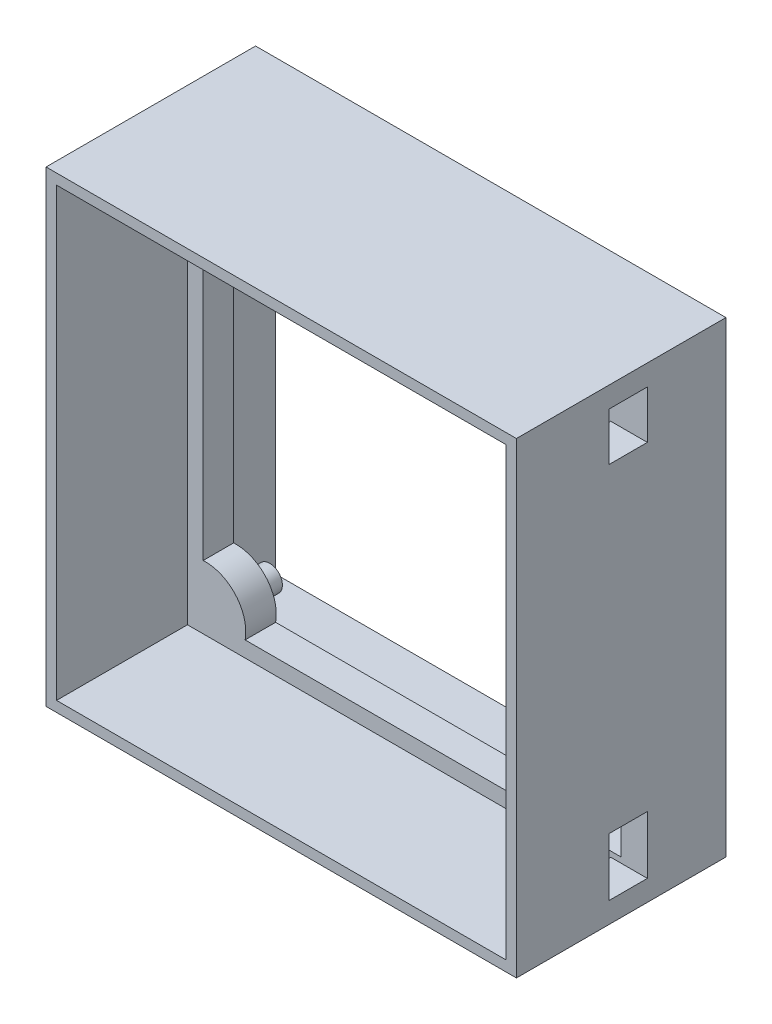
ISO-10303-21;
HEADER;
FILE_DESCRIPTION(('STEP AP214'),'2;1');
FILE_NAME('part.step','',(''),(''),'','','');
FILE_SCHEMA(('AUTOMOTIVE_DESIGN { 1 0 10303 214 1 1 1 1 }'));
ENDSEC;
DATA;
#1=APPLICATION_CONTEXT('core data for automotive mechanical design processes');
#2=APPLICATION_PROTOCOL_DEFINITION('international standard','automotive_design',2000,#1);
#3=PRODUCT_CONTEXT('',#1,'mechanical');
#4=PRODUCT('Part','Part','',(#3));
#5=PRODUCT_RELATED_PRODUCT_CATEGORY('part','',(#4));
#6=PRODUCT_DEFINITION_FORMATION('','',#4);
#7=PRODUCT_DEFINITION_CONTEXT('part definition',#1,'design');
#8=PRODUCT_DEFINITION('design','',#6,#7);
#9=PRODUCT_DEFINITION_SHAPE('','',#8);
#10=(LENGTH_UNIT() NAMED_UNIT(*) SI_UNIT(.MILLI.,.METRE.));
#11=(NAMED_UNIT(*) PLANE_ANGLE_UNIT() SI_UNIT($,.RADIAN.));
#12=(NAMED_UNIT(*) SI_UNIT($,.STERADIAN.) SOLID_ANGLE_UNIT());
#13=UNCERTAINTY_MEASURE_WITH_UNIT(LENGTH_MEASURE(1.E-05),#10,'distance_accuracy_value','');
#14=(GEOMETRIC_REPRESENTATION_CONTEXT(3) GLOBAL_UNCERTAINTY_ASSIGNED_CONTEXT((#13)) GLOBAL_UNIT_ASSIGNED_CONTEXT((#10,
#11,#12)) REPRESENTATION_CONTEXT('',''));
#15=CARTESIAN_POINT('',(0.,0.,0.));
#16=DIRECTION('',(0.,0.,1.));
#17=DIRECTION('',(1.,0.,0.));
#18=AXIS2_PLACEMENT_3D('',#15,#16,#17);
#19=CARTESIAN_POINT('',(0.,0.,15.));
#20=DIRECTION('',(0.,0.,1.));
#21=DIRECTION('',(1.,0.,0.));
#22=AXIS2_PLACEMENT_3D('',#19,#20,#21);
#23=PLANE('',#22);
#24=DIRECTION('',(0.,-1.,0.));
#25=VECTOR('',#24,1.);
#26=CARTESIAN_POINT('',(39.9,39.6,15.));
#27=LINE('',#26,#25);
#28=CARTESIAN_POINT('',(39.9,29.46,15.));
#29=VERTEX_POINT('',#28);
#30=CARTESIAN_POINT('',(39.9,-27.57,15.));
#31=VERTEX_POINT('',#30);
#32=EDGE_CURVE('E317',#29,#31,#27,.T.);
#33=ORIENTED_EDGE('',*,*,#32,.T.);
#34=DIRECTION('',(1.,0.,0.));
#35=VECTOR('',#34,1.);
#36=CARTESIAN_POINT('',(37.9,-27.57,15.));
#37=LINE('',#36,#35);
#38=CARTESIAN_POINT('',(42.9,-27.57,15.));
#39=VERTEX_POINT('',#38);
#40=EDGE_CURVE('E299',#31,#39,#37,.T.);
#41=ORIENTED_EDGE('',*,*,#40,.T.);
#42=DIRECTION('',(0.,-1.,0.));
#43=VECTOR('',#42,1.);
#44=CARTESIAN_POINT('',(42.9,42.6,15.));
#45=LINE('',#44,#43);
#46=CARTESIAN_POINT('',(42.9,29.46,15.));
#47=VERTEX_POINT('',#46);
#48=EDGE_CURVE('E315',#47,#39,#45,.T.);
#49=ORIENTED_EDGE('',*,*,#48,.F.);
#50=DIRECTION('',(1.,0.,0.));
#51=VECTOR('',#50,1.);
#52=CARTESIAN_POINT('',(37.9,29.46,15.));
#53=LINE('',#52,#51);
#54=EDGE_CURVE('E692',#29,#47,#53,.T.);
#55=ORIENTED_EDGE('',*,*,#54,.F.);
#56=EDGE_LOOP('',(#33,#41,#49,#55));
#57=FACE_BOUND('',#56,.T.);
#58=ADVANCED_FACE('F44',(#57),#23,.T.);
#59=DIRECTION('',(-1.,0.,0.));
#60=VECTOR('',#59,1.);
#61=CARTESIAN_POINT('',(48.9,-29.57,15.));
#62=LINE('',#61,#60);
#63=CARTESIAN_POINT('',(44.9,-29.57,15.));
#64=VERTEX_POINT('',#63);
#65=CARTESIAN_POINT('',(39.9,-29.57,15.));
#66=VERTEX_POINT('',#65);
#67=EDGE_CURVE('E703',#64,#66,#62,.T.);
#68=ORIENTED_EDGE('',*,*,#67,.T.);
#69=CARTESIAN_POINT('',(39.9,-39.6,15.));
#70=VERTEX_POINT('',#69);
#71=EDGE_CURVE('E326',#66,#70,#27,.T.);
#72=ORIENTED_EDGE('',*,*,#71,.T.);
#73=DIRECTION('',(-1.,0.,0.));
#74=VECTOR('',#73,1.);
#75=CARTESIAN_POINT('',(39.9,-39.6,15.));
#76=LINE('',#75,#74);
#77=CARTESIAN_POINT('',(30.7040428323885,-39.6,15.));
#78=VERTEX_POINT('',#77);
#79=EDGE_CURVE('E759',#70,#78,#76,.T.);
#80=ORIENTED_EDGE('',*,*,#79,.T.);
#81=DIRECTION('',(0.,-1.,0.));
#82=VECTOR('',#81,1.);
#83=CARTESIAN_POINT('',(30.7040428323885,-39.6,15.));
#84=LINE('',#83,#82);
#85=CARTESIAN_POINT('',(30.7040428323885,-30.0670183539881,15.));
#86=VERTEX_POINT('',#85);
#87=EDGE_CURVE('E481',#86,#78,#84,.T.);
#88=ORIENTED_EDGE('',*,*,#87,.F.);
#89=DIRECTION('',(1.,0.,0.));
#90=VECTOR('',#89,1.);
#91=CARTESIAN_POINT('',(30.7040428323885,-30.0670183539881,15.));
#92=LINE('',#91,#90);
#93=CARTESIAN_POINT('',(20.7040428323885,-30.0670183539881,15.));
#94=VERTEX_POINT('',#93);
#95=EDGE_CURVE('E502',#94,#86,#92,.T.);
#96=ORIENTED_EDGE('',*,*,#95,.F.);
#97=DIRECTION('',(0.,1.,0.));
#98=VECTOR('',#97,1.);
#99=CARTESIAN_POINT('',(20.7040428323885,-39.6,15.));
#100=LINE('',#99,#98);
#101=CARTESIAN_POINT('',(20.7040428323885,-39.6,15.));
#102=VERTEX_POINT('',#101);
#103=EDGE_CURVE('E477',#102,#94,#100,.T.);
#104=ORIENTED_EDGE('',*,*,#103,.F.);
#105=CARTESIAN_POINT('',(-31.8973437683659,-39.6,15.));
#106=VERTEX_POINT('',#105);
#107=EDGE_CURVE('E761',#102,#106,#76,.T.);
#108=ORIENTED_EDGE('',*,*,#107,.T.);
#109=CARTESIAN_POINT('',(-39.5186152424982,-38.2041357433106,15.));
#110=DIRECTION('',(0.,0.,1.));
#111=DIRECTION('',(1.,0.,0.));
#112=AXIS2_PLACEMENT_3D('',#109,#110,#111);
#113=CIRCLE('',#112,7.74804594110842);
#114=CARTESIAN_POINT('',(-39.9,-30.4654820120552,15.));
#115=VERTEX_POINT('',#114);
#116=EDGE_CURVE('E461',#106,#115,#113,.T.);
#117=ORIENTED_EDGE('',*,*,#116,.T.);
#118=DIRECTION('',(0.,1.,0.));
#119=VECTOR('',#118,1.);
#120=CARTESIAN_POINT('',(-39.9,39.6,15.));
#121=LINE('',#120,#119);
#122=CARTESIAN_POINT('',(-39.9,30.4654820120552,15.));
#123=VERTEX_POINT('',#122);
#124=EDGE_CURVE('E756',#115,#123,#121,.T.);
#125=ORIENTED_EDGE('',*,*,#124,.T.);
#126=CARTESIAN_POINT('',(-39.5186152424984,38.2041357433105,15.));
#127=DIRECTION('',(0.,0.,1.));
#128=DIRECTION('',(1.,0.,0.));
#129=AXIS2_PLACEMENT_3D('',#126,#127,#128);
#130=CIRCLE('',#129,7.74804594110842);
#131=CARTESIAN_POINT('',(-31.8973437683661,39.6,15.));
#132=VERTEX_POINT('',#131);
#133=EDGE_CURVE('E462',#132,#123,#130,.F.);
#134=ORIENTED_EDGE('',*,*,#133,.F.);
#135=DIRECTION('',(1.,0.,0.));
#136=VECTOR('',#135,1.);
#137=CARTESIAN_POINT('',(39.9,39.6,15.));
#138=LINE('',#137,#136);
#139=CARTESIAN_POINT('',(31.8973437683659,39.6,15.));
#140=VERTEX_POINT('',#139);
#141=EDGE_CURVE('E359',#132,#140,#138,.T.);
#142=ORIENTED_EDGE('',*,*,#141,.T.);
#143=CARTESIAN_POINT('',(37.6432400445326,36.5611390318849,15.));
#144=DIRECTION('',(0.,0.,1.));
#145=DIRECTION('',(1.,0.,0.));
#146=AXIS2_PLACEMENT_3D('',#143,#144,#145);
#147=CIRCLE('',#146,6.5);
#148=CARTESIAN_POINT('',(37.9,30.066212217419,15.));
#149=VERTEX_POINT('',#148);
#150=EDGE_CURVE('E517',#140,#149,#147,.T.);
#151=ORIENTED_EDGE('',*,*,#150,.T.);
#152=DIRECTION('',(0.,-1.,0.));
#153=VECTOR('',#152,1.);
#154=CARTESIAN_POINT('',(37.9,31.46,15.));
#155=LINE('',#154,#153);
#156=CARTESIAN_POINT('',(37.9,31.46,15.));
#157=VERTEX_POINT('',#156);
#158=EDGE_CURVE('E667',#157,#149,#155,.T.);
#159=ORIENTED_EDGE('',*,*,#158,.F.);
#160=DIRECTION('',(-1.,0.,0.));
#161=VECTOR('',#160,1.);
#162=CARTESIAN_POINT('',(48.9,31.46,15.));
#163=LINE('',#162,#161);
#164=CARTESIAN_POINT('',(44.9,31.46,15.));
#165=VERTEX_POINT('',#164);
#166=EDGE_CURVE('E713',#165,#157,#163,.T.);
#167=ORIENTED_EDGE('',*,*,#166,.F.);
#168=DIRECTION('',(0.,-1.,0.));
#169=VECTOR('',#168,1.);
#170=CARTESIAN_POINT('',(44.9,-44.6,15.));
#171=LINE('',#170,#169);
#172=CARTESIAN_POINT('',(44.9,40.63,15.));
#173=VERTEX_POINT('',#172);
#174=EDGE_CURVE('E343',#173,#165,#171,.T.);
#175=ORIENTED_EDGE('',*,*,#174,.F.);
#176=DIRECTION('',(-1.,0.,0.));
#177=VECTOR('',#176,1.);
#178=CARTESIAN_POINT('',(48.9,40.63,15.));
#179=LINE('',#178,#177);
#180=CARTESIAN_POINT('',(37.9,40.63,15.));
#181=VERTEX_POINT('',#180);
#182=EDGE_CURVE('E704',#173,#181,#179,.T.);
#183=ORIENTED_EDGE('',*,*,#182,.T.);
#184=DIRECTION('',(0.,-1.,0.));
#185=VECTOR('',#184,1.);
#186=CARTESIAN_POINT('',(37.9,42.63,15.));
#187=LINE('',#186,#185);
#188=CARTESIAN_POINT('',(37.9,42.6,15.));
#189=VERTEX_POINT('',#188);
#190=EDGE_CURVE('E678',#189,#181,#187,.T.);
#191=ORIENTED_EDGE('',*,*,#190,.F.);
#192=DIRECTION('',(1.,0.,0.));
#193=VECTOR('',#192,1.);
#194=CARTESIAN_POINT('',(42.9,42.6,15.));
#195=LINE('',#194,#193);
#196=CARTESIAN_POINT('',(-42.9,42.6,15.));
#197=VERTEX_POINT('',#196);
#198=EDGE_CURVE('E409',#197,#189,#195,.T.);
#199=ORIENTED_EDGE('',*,*,#198,.F.);
#200=DIRECTION('',(0.,1.,0.));
#201=VECTOR('',#200,1.);
#202=CARTESIAN_POINT('',(-42.9,42.6,15.));
#203=LINE('',#202,#201);
#204=CARTESIAN_POINT('',(-42.9,-42.6,15.));
#205=VERTEX_POINT('',#204);
#206=EDGE_CURVE('E334',#205,#197,#203,.T.);
#207=ORIENTED_EDGE('',*,*,#206,.F.);
#208=DIRECTION('',(-1.,0.,0.));
#209=VECTOR('',#208,1.);
#210=CARTESIAN_POINT('',(42.9,-42.6,15.));
#211=LINE('',#210,#209);
#212=CARTESIAN_POINT('',(37.9,-42.6,15.));
#213=VERTEX_POINT('',#212);
#214=EDGE_CURVE('E327',#213,#205,#211,.T.);
#215=ORIENTED_EDGE('',*,*,#214,.F.);
#216=DIRECTION('',(0.,-1.,0.));
#217=VECTOR('',#216,1.);
#218=CARTESIAN_POINT('',(37.9,-40.63,15.));
#219=LINE('',#218,#217);
#220=CARTESIAN_POINT('',(37.9,-40.63,15.));
#221=VERTEX_POINT('',#220);
#222=EDGE_CURVE('E610',#221,#213,#219,.T.);
#223=ORIENTED_EDGE('',*,*,#222,.F.);
#224=DIRECTION('',(-1.,0.,0.));
#225=VECTOR('',#224,1.);
#226=CARTESIAN_POINT('',(48.9,-40.63,15.));
#227=LINE('',#226,#225);
#228=CARTESIAN_POINT('',(44.9,-40.63,15.));
#229=VERTEX_POINT('',#228);
#230=EDGE_CURVE('E716',#229,#221,#227,.T.);
#231=ORIENTED_EDGE('',*,*,#230,.F.);
#232=DIRECTION('',(0.,-1.,0.));
#233=VECTOR('',#232,1.);
#234=CARTESIAN_POINT('',(44.9,-44.6,15.));
#235=LINE('',#234,#233);
#236=EDGE_CURVE('E737',#64,#229,#235,.T.);
#237=ORIENTED_EDGE('',*,*,#236,.F.);
#238=EDGE_LOOP('',(#68,#72,#80,#88,#96,#104,#108,#117,#125,#134,#142,#151,#159,#167,#175,#183,
#191,#199,#207,#215,#223,#231,#237));
#239=FACE_BOUND('',#238,.T.);
#240=ADVANCED_FACE('F608',(#239),#23,.T.);
#241=CARTESIAN_POINT('',(42.9,42.6,-105.916003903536));
#242=DIRECTION('',(1.,0.,0.));
#243=DIRECTION('',(0.,0.,-1.));
#244=AXIS2_PLACEMENT_3D('',#241,#242,#243);
#245=PLANE('',#244);
#246=DIRECTION('',(0.,1.,0.));
#247=VECTOR('',#246,1.);
#248=CARTESIAN_POINT('',(42.9,-42.63,24.3));
#249=LINE('',#248,#247);
#250=CARTESIAN_POINT('',(42.9,-42.6,24.3));
#251=VERTEX_POINT('',#250);
#252=CARTESIAN_POINT('',(42.9,-27.57,24.3));
#253=VERTEX_POINT('',#252);
#254=EDGE_CURVE('E308',#251,#253,#249,.T.);
#255=ORIENTED_EDGE('',*,*,#254,.F.);
#256=DIRECTION('',(0.,0.,1.));
#257=VECTOR('',#256,1.);
#258=CARTESIAN_POINT('',(42.9,-42.6,-105.916003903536));
#259=LINE('',#258,#257);
#260=CARTESIAN_POINT('',(42.9,-42.6,40.));
#261=VERTEX_POINT('',#260);
#262=EDGE_CURVE('E356',#251,#261,#259,.T.);
#263=ORIENTED_EDGE('',*,*,#262,.T.);
#264=DIRECTION('',(0.,1.,0.));
#265=VECTOR('',#264,1.);
#266=CARTESIAN_POINT('',(42.9,42.6,40.));
#267=LINE('',#266,#265);
#268=CARTESIAN_POINT('',(42.9,42.6,40.));
#269=VERTEX_POINT('',#268);
#270=EDGE_CURVE('E338',#261,#269,#267,.T.);
#271=ORIENTED_EDGE('',*,*,#270,.T.);
#272=DIRECTION('',(0.,0.,1.));
#273=VECTOR('',#272,1.);
#274=CARTESIAN_POINT('',(42.9,42.6,-105.916003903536));
#275=LINE('',#274,#273);
#276=CARTESIAN_POINT('',(42.9,42.6,24.33));
#277=VERTEX_POINT('',#276);
#278=EDGE_CURVE('E355',#277,#269,#275,.T.);
#279=ORIENTED_EDGE('',*,*,#278,.F.);
#280=DIRECTION('',(0.,1.,0.));
#281=VECTOR('',#280,1.);
#282=CARTESIAN_POINT('',(42.9,29.46,24.33));
#283=LINE('',#282,#281);
#284=CARTESIAN_POINT('',(42.9,29.46,24.33));
#285=VERTEX_POINT('',#284);
#286=EDGE_CURVE('E631',#285,#277,#283,.T.);
#287=ORIENTED_EDGE('',*,*,#286,.F.);
#288=DIRECTION('',(0.,0.,1.));
#289=VECTOR('',#288,1.);
#290=CARTESIAN_POINT('',(42.9,29.46,15.));
#291=LINE('',#290,#289);
#292=EDGE_CURVE('E324',#47,#285,#291,.T.);
#293=ORIENTED_EDGE('',*,*,#292,.F.);
#294=ORIENTED_EDGE('',*,*,#48,.T.);
#295=DIRECTION('',(0.,0.,-1.));
#296=VECTOR('',#295,1.);
#297=CARTESIAN_POINT('',(42.9,-27.57,24.3));
#298=LINE('',#297,#296);
#299=EDGE_CURVE('E295',#253,#39,#298,.T.);
#300=ORIENTED_EDGE('',*,*,#299,.F.);
#301=EDGE_LOOP('',(#255,#263,#271,#279,#287,#293,#294,#300));
#302=FACE_BOUND('',#301,.T.);
#303=ADVANCED_FACE('F322',(#302),#245,.F.);
#304=CARTESIAN_POINT('',(42.9,-42.6,-105.916003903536));
#305=DIRECTION('',(0.,-1.,0.));
#306=DIRECTION('',(1.,0.,0.));
#307=AXIS2_PLACEMENT_3D('',#304,#305,#306);
#308=PLANE('',#307);
#309=DIRECTION('',(1.,0.,0.));
#310=VECTOR('',#309,1.);
#311=CARTESIAN_POINT('',(42.9,-42.6,24.3));
#312=LINE('',#311,#310);
#313=CARTESIAN_POINT('',(37.9,-42.6,24.3));
#314=VERTEX_POINT('',#313);
#315=EDGE_CURVE('E11',#314,#251,#312,.T.);
#316=ORIENTED_EDGE('',*,*,#315,.F.);
#317=DIRECTION('',(0.,0.,-1.));
#318=VECTOR('',#317,1.);
#319=CARTESIAN_POINT('',(37.9,-42.6,-105.916003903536));
#320=LINE('',#319,#318);
#321=EDGE_CURVE('E53',#314,#213,#320,.T.);
#322=ORIENTED_EDGE('',*,*,#321,.T.);
#323=ORIENTED_EDGE('',*,*,#214,.T.);
#324=DIRECTION('',(0.,0.,1.));
#325=VECTOR('',#324,1.);
#326=CARTESIAN_POINT('',(-42.9,-42.6,-105.916003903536));
#327=LINE('',#326,#325);
#328=CARTESIAN_POINT('',(-42.9,-42.6,40.));
#329=VERTEX_POINT('',#328);
#330=EDGE_CURVE('E360',#205,#329,#327,.T.);
#331=ORIENTED_EDGE('',*,*,#330,.T.);
#332=DIRECTION('',(1.,0.,0.));
#333=VECTOR('',#332,1.);
#334=CARTESIAN_POINT('',(42.9,-42.6,40.));
#335=LINE('',#334,#333);
#336=EDGE_CURVE('E351',#329,#261,#335,.T.);
#337=ORIENTED_EDGE('',*,*,#336,.T.);
#338=ORIENTED_EDGE('',*,*,#262,.F.);
#339=EDGE_LOOP('',(#316,#322,#323,#331,#337,#338));
#340=FACE_BOUND('',#339,.T.);
#341=ADVANCED_FACE('F601',(#340),#308,.F.);
#342=CARTESIAN_POINT('',(42.9,42.6,-105.916003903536));
#343=DIRECTION('',(0.,1.,0.));
#344=DIRECTION('',(0.,0.,1.));
#345=AXIS2_PLACEMENT_3D('',#342,#343,#344);
#346=PLANE('',#345);
#347=DIRECTION('',(-1.,0.,0.));
#348=VECTOR('',#347,1.);
#349=CARTESIAN_POINT('',(42.9,42.6,24.33));
#350=LINE('',#349,#348);
#351=CARTESIAN_POINT('',(37.9,42.6,24.33));
#352=VERTEX_POINT('',#351);
#353=EDGE_CURVE('E697',#277,#352,#350,.T.);
#354=ORIENTED_EDGE('',*,*,#353,.F.);
#355=ORIENTED_EDGE('',*,*,#278,.T.);
#356=DIRECTION('',(-1.,0.,0.));
#357=VECTOR('',#356,1.);
#358=CARTESIAN_POINT('',(42.9,42.6,40.));
#359=LINE('',#358,#357);
#360=CARTESIAN_POINT('',(-42.9,42.6,40.));
#361=VERTEX_POINT('',#360);
#362=EDGE_CURVE('E342',#269,#361,#359,.T.);
#363=ORIENTED_EDGE('',*,*,#362,.T.);
#364=DIRECTION('',(0.,0.,1.));
#365=VECTOR('',#364,1.);
#366=CARTESIAN_POINT('',(-42.9,42.6,-105.916003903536));
#367=LINE('',#366,#365);
#368=EDGE_CURVE('E363',#197,#361,#367,.T.);
#369=ORIENTED_EDGE('',*,*,#368,.F.);
#370=ORIENTED_EDGE('',*,*,#198,.T.);
#371=DIRECTION('',(0.,0.,-1.));
#372=VECTOR('',#371,1.);
#373=CARTESIAN_POINT('',(37.9,42.6,-105.916003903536));
#374=LINE('',#373,#372);
#375=EDGE_CURVE('E594',#352,#189,#374,.T.);
#376=ORIENTED_EDGE('',*,*,#375,.F.);
#377=EDGE_LOOP('',(#354,#355,#363,#369,#370,#376));
#378=FACE_BOUND('',#377,.T.);
#379=ADVANCED_FACE('F768',(#378),#346,.F.);
#380=CARTESIAN_POINT('',(-39.9,-39.6,40.));
#381=DIRECTION('',(0.,1.,0.));
#382=DIRECTION('',(0.,0.,1.));
#383=AXIS2_PLACEMENT_3D('',#380,#381,#382);
#384=PLANE('',#383);
#385=DIRECTION('',(0.,0.,1.));
#386=VECTOR('',#385,1.);
#387=CARTESIAN_POINT('',(-31.8973437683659,-39.6,9.18));
#388=LINE('',#387,#386);
#389=CARTESIAN_POINT('',(-31.8973437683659,-39.6,9.18));
#390=VERTEX_POINT('',#389);
#391=EDGE_CURVE('E522',#390,#106,#388,.T.);
#392=ORIENTED_EDGE('',*,*,#391,.T.);
#393=ORIENTED_EDGE('',*,*,#107,.F.);
#394=DIRECTION('',(0.,0.,1.));
#395=VECTOR('',#394,1.);
#396=CARTESIAN_POINT('',(20.7040428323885,-39.6,9.18));
#397=LINE('',#396,#395);
#398=CARTESIAN_POINT('',(20.7040428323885,-39.6,9.18));
#399=VERTEX_POINT('',#398);
#400=EDGE_CURVE('E503',#399,#102,#397,.T.);
#401=ORIENTED_EDGE('',*,*,#400,.F.);
#402=DIRECTION('',(-1.,0.,0.));
#403=VECTOR('',#402,1.);
#404=CARTESIAN_POINT('',(39.9,-39.6,9.17999999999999));
#405=LINE('',#404,#403);
#406=EDGE_CURVE('E396',#399,#390,#405,.T.);
#407=ORIENTED_EDGE('',*,*,#406,.T.);
#408=EDGE_LOOP('',(#392,#393,#401,#407));
#409=FACE_BOUND('',#408,.T.);
#410=ADVANCED_FACE('F824',(#409),#384,.T.);
#411=DIRECTION('',(0.,0.,1.));
#412=VECTOR('',#411,1.);
#413=CARTESIAN_POINT('',(30.7040428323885,-39.6,9.18));
#414=LINE('',#413,#412);
#415=CARTESIAN_POINT('',(30.7040428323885,-39.6,9.17999999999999));
#416=VERTEX_POINT('',#415);
#417=EDGE_CURVE('E498',#416,#78,#414,.T.);
#418=ORIENTED_EDGE('',*,*,#417,.T.);
#419=ORIENTED_EDGE('',*,*,#79,.F.);
#420=DIRECTION('',(0.,0.,-1.));
#421=VECTOR('',#420,1.);
#422=CARTESIAN_POINT('',(39.9,-39.6,40.));
#423=LINE('',#422,#421);
#424=CARTESIAN_POINT('',(39.9,-39.6,9.17999999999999));
#425=VERTEX_POINT('',#424);
#426=EDGE_CURVE('E546',#70,#425,#423,.T.);
#427=ORIENTED_EDGE('',*,*,#426,.T.);
#428=EDGE_CURVE('E403',#425,#416,#405,.T.);
#429=ORIENTED_EDGE('',*,*,#428,.T.);
#430=EDGE_LOOP('',(#418,#419,#427,#429));
#431=FACE_BOUND('',#430,.T.);
#432=ADVANCED_FACE('F803',(#431),#384,.T.);
#433=CARTESIAN_POINT('',(-39.9,-39.6,40.));
#434=DIRECTION('',(1.,0.,0.));
#435=DIRECTION('',(0.,0.,-1.));
#436=AXIS2_PLACEMENT_3D('',#433,#434,#435);
#437=PLANE('',#436);
#438=DIRECTION('',(0.,0.,1.));
#439=VECTOR('',#438,1.);
#440=CARTESIAN_POINT('',(-39.9,30.4654820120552,9.18));
#441=LINE('',#440,#439);
#442=CARTESIAN_POINT('',(-39.9,30.4654820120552,9.18));
#443=VERTEX_POINT('',#442);
#444=EDGE_CURVE('E538',#443,#123,#441,.T.);
#445=ORIENTED_EDGE('',*,*,#444,.T.);
#446=ORIENTED_EDGE('',*,*,#124,.F.);
#447=DIRECTION('',(0.,0.,1.));
#448=VECTOR('',#447,1.);
#449=CARTESIAN_POINT('',(-39.9,-30.4654820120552,9.18));
#450=LINE('',#449,#448);
#451=CARTESIAN_POINT('',(-39.9,-30.4654820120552,9.18));
#452=VERTEX_POINT('',#451);
#453=EDGE_CURVE('E521',#452,#115,#450,.T.);
#454=ORIENTED_EDGE('',*,*,#453,.F.);
#455=DIRECTION('',(0.,1.,0.));
#456=VECTOR('',#455,1.);
#457=CARTESIAN_POINT('',(-39.9,-39.6,9.17999999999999));
#458=LINE('',#457,#456);
#459=EDGE_CURVE('E399',#452,#443,#458,.T.);
#460=ORIENTED_EDGE('',*,*,#459,.T.);
#461=EDGE_LOOP('',(#445,#446,#454,#460));
#462=FACE_BOUND('',#461,.T.);
#463=ADVANCED_FACE('F831',(#462),#437,.T.);
#464=CARTESIAN_POINT('',(39.9,-39.6,40.));
#465=DIRECTION('',(-1.,0.,0.));
#466=DIRECTION('',(0.,0.,1.));
#467=AXIS2_PLACEMENT_3D('',#464,#465,#466);
#468=PLANE('',#467);
#469=ORIENTED_EDGE('',*,*,#426,.F.);
#470=ORIENTED_EDGE('',*,*,#71,.F.);
#471=EDGE_CURVE('E331',#31,#66,#27,.T.);
#472=ORIENTED_EDGE('',*,*,#471,.F.);
#473=ORIENTED_EDGE('',*,*,#32,.F.);
#474=CARTESIAN_POINT('',(39.9,30.4654820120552,15.));
#475=VERTEX_POINT('',#474);
#476=EDGE_CURVE('E333',#475,#29,#27,.T.);
#477=ORIENTED_EDGE('',*,*,#476,.F.);
#478=DIRECTION('',(0.,0.,1.));
#479=VECTOR('',#478,1.);
#480=CARTESIAN_POINT('',(39.9,30.4654820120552,9.18));
#481=LINE('',#480,#479);
#482=CARTESIAN_POINT('',(39.9,30.4654820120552,9.17999999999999));
#483=VERTEX_POINT('',#482);
#484=EDGE_CURVE('E533',#483,#475,#481,.T.);
#485=ORIENTED_EDGE('',*,*,#484,.F.);
#486=DIRECTION('',(0.,-1.,0.));
#487=VECTOR('',#486,1.);
#488=CARTESIAN_POINT('',(39.9,-39.6,9.17999999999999));
#489=LINE('',#488,#487);
#490=EDGE_CURVE('E392',#483,#425,#489,.T.);
#491=ORIENTED_EDGE('',*,*,#490,.T.);
#492=EDGE_LOOP('',(#469,#470,#472,#473,#477,#485,#491));
#493=FACE_BOUND('',#492,.T.);
#494=ADVANCED_FACE('F785',(#493),#468,.T.);
#495=CARTESIAN_POINT('',(-39.9,39.6,40.));
#496=DIRECTION('',(0.,-1.,0.));
#497=DIRECTION('',(0.,0.,-1.));
#498=AXIS2_PLACEMENT_3D('',#495,#496,#497);
#499=PLANE('',#498);
#500=DIRECTION('',(0.,0.,1.));
#501=VECTOR('',#500,1.);
#502=CARTESIAN_POINT('',(31.8973437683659,39.6,9.18));
#503=LINE('',#502,#501);
#504=CARTESIAN_POINT('',(31.8973437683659,39.6,9.17999999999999));
#505=VERTEX_POINT('',#504);
#506=EDGE_CURVE('E534',#505,#140,#503,.T.);
#507=ORIENTED_EDGE('',*,*,#506,.T.);
#508=ORIENTED_EDGE('',*,*,#141,.F.);
#509=DIRECTION('',(0.,0.,1.));
#510=VECTOR('',#509,1.);
#511=CARTESIAN_POINT('',(-31.8973437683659,39.6,9.18));
#512=LINE('',#511,#510);
#513=CARTESIAN_POINT('',(-31.8973437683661,39.6,9.18));
#514=VERTEX_POINT('',#513);
#515=EDGE_CURVE('E542',#514,#132,#512,.T.);
#516=ORIENTED_EDGE('',*,*,#515,.F.);
#517=DIRECTION('',(1.,0.,0.));
#518=VECTOR('',#517,1.);
#519=CARTESIAN_POINT('',(39.9,39.6,9.17999999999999));
#520=LINE('',#519,#518);
#521=EDGE_CURVE('E374',#514,#505,#520,.T.);
#522=ORIENTED_EDGE('',*,*,#521,.T.);
#523=EDGE_LOOP('',(#507,#508,#516,#522));
#524=FACE_BOUND('',#523,.T.);
#525=ADVANCED_FACE('F839',(#524),#499,.T.);
#526=CARTESIAN_POINT('',(37.6432400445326,36.5611390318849,9.18));
#527=DIRECTION('',(0.,0.,1.));
#528=DIRECTION('',(1.,0.,0.));
#529=AXIS2_PLACEMENT_3D('',#526,#527,#528);
#530=CYLINDRICAL_SURFACE('',#529,6.5);
#531=ORIENTED_EDGE('',*,*,#150,.F.);
#532=ORIENTED_EDGE('',*,*,#506,.F.);
#533=CARTESIAN_POINT('',(37.6432400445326,36.5611390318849,9.18));
#534=DIRECTION('',(0.,0.,1.));
#535=DIRECTION('',(1.,0.,0.));
#536=AXIS2_PLACEMENT_3D('',#533,#534,#535);
#537=CIRCLE('',#536,6.5);
#538=EDGE_CURVE('E526',#483,#505,#537,.F.);
#539=ORIENTED_EDGE('',*,*,#538,.F.);
#540=ORIENTED_EDGE('',*,*,#484,.T.);
#541=CARTESIAN_POINT('',(37.6432400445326,36.5611390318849,15.));
#542=DIRECTION('',(0.,0.,1.));
#543=DIRECTION('',(1.,0.,0.));
#544=AXIS2_PLACEMENT_3D('',#541,#542,#543);
#545=CIRCLE('',#544,6.5);
#546=EDGE_CURVE('E700',#149,#475,#545,.T.);
#547=ORIENTED_EDGE('',*,*,#546,.F.);
#548=EDGE_LOOP('',(#531,#532,#539,#540,#547));
#549=FACE_BOUND('',#548,.T.);
#550=ADVANCED_FACE('F845',(#549),#530,.T.);
#551=CARTESIAN_POINT('',(0.,0.,40.));
#552=DIRECTION('',(0.,0.,1.));
#553=DIRECTION('',(1.,0.,0.));
#554=AXIS2_PLACEMENT_3D('',#551,#552,#553);
#555=PLANE('',#554);
#556=ORIENTED_EDGE('',*,*,#362,.F.);
#557=ORIENTED_EDGE('',*,*,#270,.F.);
#558=ORIENTED_EDGE('',*,*,#336,.F.);
#559=DIRECTION('',(0.,-1.,0.));
#560=VECTOR('',#559,1.);
#561=CARTESIAN_POINT('',(-42.9,42.6,40.));
#562=LINE('',#561,#560);
#563=EDGE_CURVE('E347',#361,#329,#562,.T.);
#564=ORIENTED_EDGE('',*,*,#563,.F.);
#565=EDGE_LOOP('',(#556,#557,#558,#564));
#566=FACE_BOUND('',#565,.T.);
#567=DIRECTION('',(1.,0.,0.));
#568=VECTOR('',#567,1.);
#569=CARTESIAN_POINT('',(-44.9,-44.6,40.));
#570=LINE('',#569,#568);
#571=CARTESIAN_POINT('',(-44.9,-44.6,40.));
#572=VERTEX_POINT('',#571);
#573=CARTESIAN_POINT('',(44.9,-44.6,40.));
#574=VERTEX_POINT('',#573);
#575=EDGE_CURVE('E553',#572,#574,#570,.T.);
#576=ORIENTED_EDGE('',*,*,#575,.T.);
#577=DIRECTION('',(0.,1.,0.));
#578=VECTOR('',#577,1.);
#579=CARTESIAN_POINT('',(44.9,-44.6,40.));
#580=LINE('',#579,#578);
#581=CARTESIAN_POINT('',(44.9,44.6,40.));
#582=VERTEX_POINT('',#581);
#583=EDGE_CURVE('E557',#574,#582,#580,.T.);
#584=ORIENTED_EDGE('',*,*,#583,.T.);
#585=DIRECTION('',(-1.,0.,0.));
#586=VECTOR('',#585,1.);
#587=CARTESIAN_POINT('',(-44.9,44.6,40.));
#588=LINE('',#587,#586);
#589=CARTESIAN_POINT('',(-44.9,44.6,40.));
#590=VERTEX_POINT('',#589);
#591=EDGE_CURVE('E561',#582,#590,#588,.T.);
#592=ORIENTED_EDGE('',*,*,#591,.T.);
#593=DIRECTION('',(0.,-1.,0.));
#594=VECTOR('',#593,1.);
#595=CARTESIAN_POINT('',(-44.9,-44.6,40.));
#596=LINE('',#595,#594);
#597=EDGE_CURVE('E564',#590,#572,#596,.T.);
#598=ORIENTED_EDGE('',*,*,#597,.T.);
#599=EDGE_LOOP('',(#576,#584,#592,#598));
#600=FACE_BOUND('',#599,.T.);
#601=ADVANCED_FACE('F624',(#566,#600),#555,.T.);
#602=CARTESIAN_POINT('',(0.,0.,0.));
#603=DIRECTION('',(0.,0.,1.));
#604=DIRECTION('',(1.,0.,0.));
#605=AXIS2_PLACEMENT_3D('',#602,#603,#604);
#606=PLANE('',#605);
#607=DIRECTION('',(-1.,0.,0.));
#608=VECTOR('',#607,1.);
#609=CARTESIAN_POINT('',(41.1,-40.8,0.));
#610=LINE('',#609,#608);
#611=CARTESIAN_POINT('',(41.1,-40.8,0.));
#612=VERTEX_POINT('',#611);
#613=CARTESIAN_POINT('',(-41.1,-40.8,0.));
#614=VERTEX_POINT('',#613);
#615=EDGE_CURVE('E379',#612,#614,#610,.T.);
#616=ORIENTED_EDGE('',*,*,#615,.F.);
#617=DIRECTION('',(0.,-1.,0.));
#618=VECTOR('',#617,1.);
#619=CARTESIAN_POINT('',(41.1,-40.8,0.));
#620=LINE('',#619,#618);
#621=CARTESIAN_POINT('',(41.1,40.8,0.));
#622=VERTEX_POINT('',#621);
#623=EDGE_CURVE('E383',#622,#612,#620,.T.);
#624=ORIENTED_EDGE('',*,*,#623,.F.);
#625=DIRECTION('',(1.,0.,0.));
#626=VECTOR('',#625,1.);
#627=CARTESIAN_POINT('',(41.1,40.8,0.));
#628=LINE('',#627,#626);
#629=CARTESIAN_POINT('',(-41.1,40.8,0.));
#630=VERTEX_POINT('',#629);
#631=EDGE_CURVE('E370',#630,#622,#628,.T.);
#632=ORIENTED_EDGE('',*,*,#631,.F.);
#633=DIRECTION('',(0.,1.,0.));
#634=VECTOR('',#633,1.);
#635=CARTESIAN_POINT('',(-41.1,-40.8,0.));
#636=LINE('',#635,#634);
#637=EDGE_CURVE('E375',#614,#630,#636,.T.);
#638=ORIENTED_EDGE('',*,*,#637,.F.);
#639=EDGE_LOOP('',(#616,#624,#632,#638));
#640=FACE_BOUND('',#639,.T.);
#641=DIRECTION('',(1.,0.,0.));
#642=VECTOR('',#641,1.);
#643=CARTESIAN_POINT('',(-44.9,-44.6,0.));
#644=LINE('',#643,#642);
#645=CARTESIAN_POINT('',(-44.9,-44.6,0.));
#646=VERTEX_POINT('',#645);
#647=CARTESIAN_POINT('',(44.9,-44.6,0.));
#648=VERTEX_POINT('',#647);
#649=EDGE_CURVE('E552',#646,#648,#644,.T.);
#650=ORIENTED_EDGE('',*,*,#649,.F.);
#651=DIRECTION('',(0.,-1.,0.));
#652=VECTOR('',#651,1.);
#653=CARTESIAN_POINT('',(-44.9,-44.6,0.));
#654=LINE('',#653,#652);
#655=CARTESIAN_POINT('',(-44.9,44.6,0.));
#656=VERTEX_POINT('',#655);
#657=EDGE_CURVE('E558',#656,#646,#654,.T.);
#658=ORIENTED_EDGE('',*,*,#657,.F.);
#659=DIRECTION('',(-1.,0.,0.));
#660=VECTOR('',#659,1.);
#661=CARTESIAN_POINT('',(-44.9,44.6,0.));
#662=LINE('',#661,#660);
#663=CARTESIAN_POINT('',(44.9,44.6,0.));
#664=VERTEX_POINT('',#663);
#665=EDGE_CURVE('E574',#664,#656,#662,.T.);
#666=ORIENTED_EDGE('',*,*,#665,.F.);
#667=DIRECTION('',(0.,1.,0.));
#668=VECTOR('',#667,1.);
#669=CARTESIAN_POINT('',(44.9,-44.6,0.));
#670=LINE('',#669,#668);
#671=EDGE_CURVE('E571',#648,#664,#670,.T.);
#672=ORIENTED_EDGE('',*,*,#671,.F.);
#673=EDGE_LOOP('',(#650,#658,#666,#672));
#674=FACE_BOUND('',#673,.T.);
#675=ADVANCED_FACE('F895',(#640,#674),#606,.F.);
#676=CARTESIAN_POINT('',(-44.9,-44.6,40.));
#677=DIRECTION('',(0.,1.,0.));
#678=DIRECTION('',(0.,0.,1.));
#679=AXIS2_PLACEMENT_3D('',#676,#677,#678);
#680=PLANE('',#679);
#681=ORIENTED_EDGE('',*,*,#649,.T.);
#682=DIRECTION('',(0.,0.,-1.));
#683=VECTOR('',#682,1.);
#684=CARTESIAN_POINT('',(44.9,-44.6,40.));
#685=LINE('',#684,#683);
#686=EDGE_CURVE('E590',#574,#648,#685,.T.);
#687=ORIENTED_EDGE('',*,*,#686,.F.);
#688=ORIENTED_EDGE('',*,*,#575,.F.);
#689=DIRECTION('',(0.,0.,-1.));
#690=VECTOR('',#689,1.);
#691=CARTESIAN_POINT('',(-44.9,-44.6,40.));
#692=LINE('',#691,#690);
#693=EDGE_CURVE('E567',#572,#646,#692,.T.);
#694=ORIENTED_EDGE('',*,*,#693,.T.);
#695=EDGE_LOOP('',(#681,#687,#688,#694));
#696=FACE_BOUND('',#695,.T.);
#697=ADVANCED_FACE('F46',(#696),#680,.F.);
#698=CARTESIAN_POINT('',(44.9,-44.6,40.));
#699=DIRECTION('',(-1.,0.,0.));
#700=DIRECTION('',(0.,-1.,0.));
#701=AXIS2_PLACEMENT_3D('',#698,#699,#700);
#702=PLANE('',#701);
#703=DIRECTION('',(0.,0.,-1.));
#704=VECTOR('',#703,1.);
#705=CARTESIAN_POINT('',(44.9,40.63,40.));
#706=LINE('',#705,#704);
#707=CARTESIAN_POINT('',(44.9,40.63,22.33));
#708=VERTEX_POINT('',#707);
#709=EDGE_CURVE('E749',#708,#173,#706,.T.);
#710=ORIENTED_EDGE('',*,*,#709,.T.);
#711=ORIENTED_EDGE('',*,*,#174,.T.);
#712=DIRECTION('',(0.,0.,1.));
#713=VECTOR('',#712,1.);
#714=CARTESIAN_POINT('',(44.9,31.46,40.));
#715=LINE('',#714,#713);
#716=CARTESIAN_POINT('',(44.9,31.46,22.33));
#717=VERTEX_POINT('',#716);
#718=EDGE_CURVE('E741',#165,#717,#715,.T.);
#719=ORIENTED_EDGE('',*,*,#718,.T.);
#720=DIRECTION('',(0.,1.,0.));
#721=VECTOR('',#720,1.);
#722=CARTESIAN_POINT('',(44.9,-44.6,22.33));
#723=LINE('',#722,#721);
#724=EDGE_CURVE('E745',#717,#708,#723,.T.);
#725=ORIENTED_EDGE('',*,*,#724,.T.);
#726=EDGE_LOOP('',(#710,#711,#719,#725));
#727=FACE_BOUND('',#726,.T.);
#728=DIRECTION('',(0.,0.,-1.));
#729=VECTOR('',#728,1.);
#730=CARTESIAN_POINT('',(44.9,-29.57,40.));
#731=LINE('',#730,#729);
#732=CARTESIAN_POINT('',(44.9,-29.57,22.3));
#733=VERTEX_POINT('',#732);
#734=EDGE_CURVE('E733',#733,#64,#731,.T.);
#735=ORIENTED_EDGE('',*,*,#734,.T.);
#736=ORIENTED_EDGE('',*,*,#236,.T.);
#737=DIRECTION('',(0.,0.,1.));
#738=VECTOR('',#737,1.);
#739=CARTESIAN_POINT('',(44.9,-40.63,40.));
#740=LINE('',#739,#738);
#741=CARTESIAN_POINT('',(44.9,-40.63,22.3));
#742=VERTEX_POINT('',#741);
#743=EDGE_CURVE('E707',#229,#742,#740,.T.);
#744=ORIENTED_EDGE('',*,*,#743,.T.);
#745=DIRECTION('',(0.,1.,0.));
#746=VECTOR('',#745,1.);
#747=CARTESIAN_POINT('',(44.9,-44.6,22.3));
#748=LINE('',#747,#746);
#749=EDGE_CURVE('E729',#742,#733,#748,.T.);
#750=ORIENTED_EDGE('',*,*,#749,.T.);
#751=EDGE_LOOP('',(#735,#736,#744,#750));
#752=FACE_BOUND('',#751,.T.);
#753=ORIENTED_EDGE('',*,*,#671,.T.);
#754=DIRECTION('',(0.,0.,-1.));
#755=VECTOR('',#754,1.);
#756=CARTESIAN_POINT('',(44.9,44.6,40.));
#757=LINE('',#756,#755);
#758=EDGE_CURVE('E586',#582,#664,#757,.T.);
#759=ORIENTED_EDGE('',*,*,#758,.F.);
#760=ORIENTED_EDGE('',*,*,#583,.F.);
#761=ORIENTED_EDGE('',*,*,#686,.T.);
#762=EDGE_LOOP('',(#753,#759,#760,#761));
#763=FACE_BOUND('',#762,.T.);
#764=ADVANCED_FACE('F852',(#727,#752,#763),#702,.F.);
#765=CARTESIAN_POINT('',(-44.9,44.6,40.));
#766=DIRECTION('',(0.,-1.,0.));
#767=DIRECTION('',(1.,0.,0.));
#768=AXIS2_PLACEMENT_3D('',#765,#766,#767);
#769=PLANE('',#768);
#770=ORIENTED_EDGE('',*,*,#665,.T.);
#771=DIRECTION('',(0.,0.,-1.));
#772=VECTOR('',#771,1.);
#773=CARTESIAN_POINT('',(-44.9,44.6,40.));
#774=LINE('',#773,#772);
#775=EDGE_CURVE('E582',#590,#656,#774,.T.);
#776=ORIENTED_EDGE('',*,*,#775,.F.);
#777=ORIENTED_EDGE('',*,*,#591,.F.);
#778=ORIENTED_EDGE('',*,*,#758,.T.);
#779=EDGE_LOOP('',(#770,#776,#777,#778));
#780=FACE_BOUND('',#779,.T.);
#781=ADVANCED_FACE('F901',(#780),#769,.F.);
#782=CARTESIAN_POINT('',(-44.9,-44.6,40.));
#783=DIRECTION('',(1.,0.,0.));
#784=DIRECTION('',(0.,1.,0.));
#785=AXIS2_PLACEMENT_3D('',#782,#783,#784);
#786=PLANE('',#785);
#787=ORIENTED_EDGE('',*,*,#657,.T.);
#788=ORIENTED_EDGE('',*,*,#693,.F.);
#789=ORIENTED_EDGE('',*,*,#597,.F.);
#790=ORIENTED_EDGE('',*,*,#775,.T.);
#791=EDGE_LOOP('',(#787,#788,#789,#790));
#792=FACE_BOUND('',#791,.T.);
#793=ADVANCED_FACE('F882',(#792),#786,.F.);
#794=CARTESIAN_POINT('',(0.,0.,9.18));
#795=DIRECTION('',(0.,0.,1.));
#796=DIRECTION('',(1.,0.,0.));
#797=AXIS2_PLACEMENT_3D('',#794,#795,#796);
#798=PLANE('',#797);
#799=ORIENTED_EDGE('',*,*,#490,.F.);
#800=ORIENTED_EDGE('',*,*,#538,.T.);
#801=ORIENTED_EDGE('',*,*,#521,.F.);
#802=CARTESIAN_POINT('',(-39.5186152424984,38.2041357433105,9.18));
#803=DIRECTION('',(0.,0.,1.));
#804=DIRECTION('',(1.,0.,0.));
#805=AXIS2_PLACEMENT_3D('',#802,#803,#804);
#806=CIRCLE('',#805,7.74804594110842);
#807=EDGE_CURVE('E466',#514,#443,#806,.F.);
#808=ORIENTED_EDGE('',*,*,#807,.T.);
#809=ORIENTED_EDGE('',*,*,#459,.F.);
#810=CARTESIAN_POINT('',(-39.5186152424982,-38.2041357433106,9.18));
#811=DIRECTION('',(0.,0.,1.));
#812=DIRECTION('',(1.,0.,0.));
#813=AXIS2_PLACEMENT_3D('',#810,#811,#812);
#814=CIRCLE('',#813,7.74804594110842);
#815=EDGE_CURVE('E473',#390,#452,#814,.T.);
#816=ORIENTED_EDGE('',*,*,#815,.F.);
#817=ORIENTED_EDGE('',*,*,#406,.F.);
#818=DIRECTION('',(0.,-1.,0.));
#819=VECTOR('',#818,1.);
#820=CARTESIAN_POINT('',(20.7040428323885,-39.6,9.18));
#821=LINE('',#820,#819);
#822=CARTESIAN_POINT('',(20.7040428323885,-30.0670183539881,9.18));
#823=VERTEX_POINT('',#822);
#824=EDGE_CURVE('E493',#823,#399,#821,.T.);
#825=ORIENTED_EDGE('',*,*,#824,.F.);
#826=DIRECTION('',(-1.,0.,0.));
#827=VECTOR('',#826,1.);
#828=CARTESIAN_POINT('',(30.7040428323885,-30.0670183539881,9.18));
#829=LINE('',#828,#827);
#830=CARTESIAN_POINT('',(30.7040428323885,-30.0670183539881,9.18));
#831=VERTEX_POINT('',#830);
#832=EDGE_CURVE('E489',#831,#823,#829,.T.);
#833=ORIENTED_EDGE('',*,*,#832,.F.);
#834=DIRECTION('',(0.,1.,0.));
#835=VECTOR('',#834,1.);
#836=CARTESIAN_POINT('',(30.7040428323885,-39.6,9.18));
#837=LINE('',#836,#835);
#838=EDGE_CURVE('E485',#416,#831,#837,.T.);
#839=ORIENTED_EDGE('',*,*,#838,.F.);
#840=ORIENTED_EDGE('',*,*,#428,.F.);
#841=EDGE_LOOP('',(#799,#800,#801,#808,#809,#816,#817,#825,#833,#839,#840));
#842=FACE_BOUND('',#841,.T.);
#843=CARTESIAN_POINT('',(36.,35.6,9.18));
#844=DIRECTION('',(0.,0.,1.));
#845=DIRECTION('',(1.,0.,0.));
#846=AXIS2_PLACEMENT_3D('',#843,#844,#845);
#847=CIRCLE('',#846,2.4);
#848=CARTESIAN_POINT('',(33.6,35.6,9.18));
#849=VERTEX_POINT('',#848);
#850=EDGE_CURVE('E449',#849,#849,#847,.T.);
#851=ORIENTED_EDGE('',*,*,#850,.T.);
#852=EDGE_LOOP('',(#851));
#853=FACE_BOUND('',#852,.T.);
#854=CARTESIAN_POINT('',(26.2,-34.8,9.18));
#855=DIRECTION('',(0.,0.,1.));
#856=DIRECTION('',(1.,0.,0.));
#857=AXIS2_PLACEMENT_3D('',#854,#855,#856);
#858=CIRCLE('',#857,2.4);
#859=CARTESIAN_POINT('',(23.8,-34.8,9.18));
#860=VERTEX_POINT('',#859);
#861=EDGE_CURVE('E457',#860,#860,#858,.T.);
#862=ORIENTED_EDGE('',*,*,#861,.T.);
#863=EDGE_LOOP('',(#862));
#864=FACE_BOUND('',#863,.T.);
#865=DIRECTION('',(0.,-1.,0.));
#866=VECTOR('',#865,1.);
#867=CARTESIAN_POINT('',(41.1,-40.8,9.17999999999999));
#868=LINE('',#867,#866);
#869=CARTESIAN_POINT('',(41.1,40.8,9.17999999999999));
#870=VERTEX_POINT('',#869);
#871=CARTESIAN_POINT('',(41.1,-40.8,9.17999999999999));
#872=VERTEX_POINT('',#871);
#873=EDGE_CURVE('E404',#870,#872,#868,.T.);
#874=ORIENTED_EDGE('',*,*,#873,.T.);
#875=DIRECTION('',(-1.,0.,0.));
#876=VECTOR('',#875,1.);
#877=CARTESIAN_POINT('',(41.1,-40.8,9.17999999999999));
#878=LINE('',#877,#876);
#879=CARTESIAN_POINT('',(-41.1,-40.8,9.17999999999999));
#880=VERTEX_POINT('',#879);
#881=EDGE_CURVE('E387',#872,#880,#878,.T.);
#882=ORIENTED_EDGE('',*,*,#881,.T.);
#883=DIRECTION('',(0.,1.,0.));
#884=VECTOR('',#883,1.);
#885=CARTESIAN_POINT('',(-41.1,-40.8,9.17999999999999));
#886=LINE('',#885,#884);
#887=CARTESIAN_POINT('',(-41.1,40.8,9.17999999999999));
#888=VERTEX_POINT('',#887);
#889=EDGE_CURVE('E415',#880,#888,#886,.T.);
#890=ORIENTED_EDGE('',*,*,#889,.T.);
#891=DIRECTION('',(1.,0.,0.));
#892=VECTOR('',#891,1.);
#893=CARTESIAN_POINT('',(41.1,40.8,9.17999999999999));
#894=LINE('',#893,#892);
#895=EDGE_CURVE('E410',#888,#870,#894,.T.);
#896=ORIENTED_EDGE('',*,*,#895,.T.);
#897=EDGE_LOOP('',(#874,#882,#890,#896));
#898=FACE_BOUND('',#897,.T.);
#899=CARTESIAN_POINT('',(-35.8,35.4,9.18));
#900=DIRECTION('',(0.,0.,1.));
#901=DIRECTION('',(1.,0.,0.));
#902=AXIS2_PLACEMENT_3D('',#899,#900,#901);
#903=CIRCLE('',#902,2.4);
#904=CARTESIAN_POINT('',(-38.2,35.4,9.18));
#905=VERTEX_POINT('',#904);
#906=EDGE_CURVE('E441',#905,#905,#903,.T.);
#907=ORIENTED_EDGE('',*,*,#906,.T.);
#908=EDGE_LOOP('',(#907));
#909=FACE_BOUND('',#908,.T.);
#910=CARTESIAN_POINT('',(-35.5,-35.3,9.18));
#911=DIRECTION('',(0.,0.,1.));
#912=DIRECTION('',(1.,0.,0.));
#913=AXIS2_PLACEMENT_3D('',#910,#911,#912);
#914=CIRCLE('',#913,2.4);
#915=CARTESIAN_POINT('',(-37.9,-35.3,9.18));
#916=VERTEX_POINT('',#915);
#917=EDGE_CURVE('E433',#916,#916,#914,.T.);
#918=ORIENTED_EDGE('',*,*,#917,.T.);
#919=EDGE_LOOP('',(#918));
#920=FACE_BOUND('',#919,.T.);
#921=ADVANCED_FACE('F817',(#842,#853,#864,#898,#909,#920),#798,.F.);
#922=CARTESIAN_POINT('',(30.7040428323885,-39.6,9.18));
#923=DIRECTION('',(1.,0.,0.));
#924=DIRECTION('',(0.,0.,-1.));
#925=AXIS2_PLACEMENT_3D('',#922,#923,#924);
#926=PLANE('',#925);
#927=DIRECTION('',(0.,0.,1.));
#928=VECTOR('',#927,1.);
#929=CARTESIAN_POINT('',(30.7040428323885,-30.0670183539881,9.18));
#930=LINE('',#929,#928);
#931=EDGE_CURVE('E497',#831,#86,#930,.T.);
#932=ORIENTED_EDGE('',*,*,#931,.T.);
#933=ORIENTED_EDGE('',*,*,#87,.T.);
#934=ORIENTED_EDGE('',*,*,#417,.F.);
#935=ORIENTED_EDGE('',*,*,#838,.T.);
#936=EDGE_LOOP('',(#932,#933,#934,#935));
#937=FACE_BOUND('',#936,.T.);
#938=ADVANCED_FACE('F808',(#937),#926,.T.);
#939=CARTESIAN_POINT('',(20.7040428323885,-39.6,9.18));
#940=DIRECTION('',(-1.,0.,0.));
#941=DIRECTION('',(0.,0.,1.));
#942=AXIS2_PLACEMENT_3D('',#939,#940,#941);
#943=PLANE('',#942);
#944=ORIENTED_EDGE('',*,*,#400,.T.);
#945=ORIENTED_EDGE('',*,*,#103,.T.);
#946=DIRECTION('',(0.,0.,1.));
#947=VECTOR('',#946,1.);
#948=CARTESIAN_POINT('',(20.7040428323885,-30.0670183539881,9.18));
#949=LINE('',#948,#947);
#950=EDGE_CURVE('E507',#823,#94,#949,.T.);
#951=ORIENTED_EDGE('',*,*,#950,.F.);
#952=ORIENTED_EDGE('',*,*,#824,.T.);
#953=EDGE_LOOP('',(#944,#945,#951,#952));
#954=FACE_BOUND('',#953,.T.);
#955=ADVANCED_FACE('F815',(#954),#943,.T.);
#956=CARTESIAN_POINT('',(30.7040428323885,-30.0670183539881,9.18));
#957=DIRECTION('',(0.,1.,0.));
#958=DIRECTION('',(0.,0.,1.));
#959=AXIS2_PLACEMENT_3D('',#956,#957,#958);
#960=PLANE('',#959);
#961=ORIENTED_EDGE('',*,*,#950,.T.);
#962=ORIENTED_EDGE('',*,*,#95,.T.);
#963=ORIENTED_EDGE('',*,*,#931,.F.);
#964=ORIENTED_EDGE('',*,*,#832,.T.);
#965=EDGE_LOOP('',(#961,#962,#963,#964));
#966=FACE_BOUND('',#965,.T.);
#967=ADVANCED_FACE('F811',(#966),#960,.T.);
#968=CARTESIAN_POINT('',(-39.5186152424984,38.2041357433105,-3.));
#969=DIRECTION('',(0.,0.,1.));
#970=DIRECTION('',(1.,0.,0.));
#971=AXIS2_PLACEMENT_3D('',#968,#969,#970);
#972=CYLINDRICAL_SURFACE('',#971,7.74804594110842);
#973=ORIENTED_EDGE('',*,*,#515,.T.);
#974=ORIENTED_EDGE('',*,*,#133,.T.);
#975=ORIENTED_EDGE('',*,*,#444,.F.);
#976=ORIENTED_EDGE('',*,*,#807,.F.);
#977=EDGE_LOOP('',(#973,#974,#975,#976));
#978=FACE_BOUND('',#977,.T.);
#979=ADVANCED_FACE('F835',(#978),#972,.T.);
#980=CARTESIAN_POINT('',(-39.5186152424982,-38.2041357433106,-3.));
#981=DIRECTION('',(0.,0.,1.));
#982=DIRECTION('',(1.,0.,0.));
#983=AXIS2_PLACEMENT_3D('',#980,#981,#982);
#984=CYLINDRICAL_SURFACE('',#983,7.74804594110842);
#985=ORIENTED_EDGE('',*,*,#815,.T.);
#986=ORIENTED_EDGE('',*,*,#453,.T.);
#987=ORIENTED_EDGE('',*,*,#116,.F.);
#988=ORIENTED_EDGE('',*,*,#391,.F.);
#989=EDGE_LOOP('',(#985,#986,#987,#988));
#990=FACE_BOUND('',#989,.T.);
#991=ADVANCED_FACE('F828',(#990),#984,.T.);
#992=CARTESIAN_POINT('',(26.2,-34.8,21.7882250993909));
#993=DIRECTION('',(0.,0.,-1.));
#994=DIRECTION('',(-1.,0.,0.));
#995=AXIS2_PLACEMENT_3D('',#992,#993,#994);
#996=CYLINDRICAL_SURFACE('',#995,2.4);
#997=CARTESIAN_POINT('',(26.2,-34.8,6.68));
#998=DIRECTION('',(0.,0.,-1.));
#999=DIRECTION('',(-1.,0.,0.));
#1000=AXIS2_PLACEMENT_3D('',#997,#998,#999);
#1001=CIRCLE('',#1000,2.4);
#1002=CARTESIAN_POINT('',(23.8,-34.8,6.68));
#1003=VERTEX_POINT('',#1002);
#1004=EDGE_CURVE('E453',#1003,#1003,#1001,.T.);
#1005=CARTESIAN_POINT('',(23.8,-34.8,6.68));
#1006=CARTESIAN_POINT('',(23.8,-34.8,6.70604166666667));
#1007=CARTESIAN_POINT('',(23.8,-34.8,6.73208333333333));
#1008=CARTESIAN_POINT('',(23.8,-34.8,6.78416666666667));
#1009=CARTESIAN_POINT('',(23.8,-34.8,6.81020833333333));
#1010=CARTESIAN_POINT('',(23.8,-34.8,6.86229166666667));
#1011=CARTESIAN_POINT('',(23.8,-34.8,6.88833333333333));
#1012=CARTESIAN_POINT('',(23.8,-34.8,6.94041666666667));
#1013=CARTESIAN_POINT('',(23.8,-34.8,6.96645833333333));
#1014=CARTESIAN_POINT('',(23.8,-34.8,7.01854166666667));
#1015=CARTESIAN_POINT('',(23.8,-34.8,7.04458333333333));
#1016=CARTESIAN_POINT('',(23.8,-34.8,7.09666666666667));
#1017=CARTESIAN_POINT('',(23.8,-34.8,7.12270833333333));
#1018=CARTESIAN_POINT('',(23.8,-34.8,7.17479166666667));
#1019=CARTESIAN_POINT('',(23.8,-34.8,7.20083333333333));
#1020=CARTESIAN_POINT('',(23.8,-34.8,7.25291666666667));
#1021=CARTESIAN_POINT('',(23.8,-34.8,7.27895833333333));
#1022=CARTESIAN_POINT('',(23.8,-34.8,7.33104166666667));
#1023=CARTESIAN_POINT('',(23.8,-34.8,7.35708333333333));
#1024=CARTESIAN_POINT('',(23.8,-34.8,7.40916666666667));
#1025=CARTESIAN_POINT('',(23.8,-34.8,7.43520833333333));
#1026=CARTESIAN_POINT('',(23.8,-34.8,7.48729166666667));
#1027=CARTESIAN_POINT('',(23.8,-34.8,7.51333333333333));
#1028=CARTESIAN_POINT('',(23.8,-34.8,7.56541666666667));
#1029=CARTESIAN_POINT('',(23.8,-34.8,7.59145833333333));
#1030=CARTESIAN_POINT('',(23.8,-34.8,7.64354166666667));
#1031=CARTESIAN_POINT('',(23.8,-34.8,7.66958333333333));
#1032=CARTESIAN_POINT('',(23.8,-34.8,7.72166666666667));
#1033=CARTESIAN_POINT('',(23.8,-34.8,7.74770833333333));
#1034=CARTESIAN_POINT('',(23.8,-34.8,7.79979166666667));
#1035=CARTESIAN_POINT('',(23.8,-34.8,7.82583333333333));
#1036=CARTESIAN_POINT('',(23.8,-34.8,7.87791666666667));
#1037=CARTESIAN_POINT('',(23.8,-34.8,7.90395833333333));
#1038=CARTESIAN_POINT('',(23.8,-34.8,7.95604166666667));
#1039=CARTESIAN_POINT('',(23.8,-34.8,7.98208333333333));
#1040=CARTESIAN_POINT('',(23.8,-34.8,8.03416666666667));
#1041=CARTESIAN_POINT('',(23.8,-34.8,8.06020833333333));
#1042=CARTESIAN_POINT('',(23.8,-34.8,8.11229166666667));
#1043=CARTESIAN_POINT('',(23.8,-34.8,8.13833333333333));
#1044=CARTESIAN_POINT('',(23.8,-34.8,8.19041666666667));
#1045=CARTESIAN_POINT('',(23.8,-34.8,8.21645833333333));
#1046=CARTESIAN_POINT('',(23.8,-34.8,8.26854166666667));
#1047=CARTESIAN_POINT('',(23.8,-34.8,8.29458333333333));
#1048=CARTESIAN_POINT('',(23.8,-34.8,8.34666666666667));
#1049=CARTESIAN_POINT('',(23.8,-34.8,8.37270833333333));
#1050=CARTESIAN_POINT('',(23.8,-34.8,8.42479166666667));
#1051=CARTESIAN_POINT('',(23.8,-34.8,8.45083333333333));
#1052=CARTESIAN_POINT('',(23.8,-34.8,8.50291666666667));
#1053=CARTESIAN_POINT('',(23.8,-34.8,8.52895833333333));
#1054=CARTESIAN_POINT('',(23.8,-34.8,8.58104166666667));
#1055=CARTESIAN_POINT('',(23.8,-34.8,8.60708333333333));
#1056=CARTESIAN_POINT('',(23.8,-34.8,8.65916666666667));
#1057=CARTESIAN_POINT('',(23.8,-34.8,8.68520833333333));
#1058=CARTESIAN_POINT('',(23.8,-34.8,8.73729166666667));
#1059=CARTESIAN_POINT('',(23.8,-34.8,8.76333333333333));
#1060=CARTESIAN_POINT('',(23.8,-34.8,8.81541666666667));
#1061=CARTESIAN_POINT('',(23.8,-34.8,8.84145833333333));
#1062=CARTESIAN_POINT('',(23.8,-34.8,8.89354166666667));
#1063=CARTESIAN_POINT('',(23.8,-34.8,8.91958333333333));
#1064=CARTESIAN_POINT('',(23.8,-34.8,8.97166666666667));
#1065=CARTESIAN_POINT('',(23.8,-34.8,8.99770833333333));
#1066=CARTESIAN_POINT('',(23.8,-34.8,9.04979166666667));
#1067=CARTESIAN_POINT('',(23.8,-34.8,9.07583333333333));
#1068=CARTESIAN_POINT('',(23.8,-34.8,9.12791666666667));
#1069=CARTESIAN_POINT('',(23.8,-34.8,9.15395833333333));
#1070=CARTESIAN_POINT('',(23.8,-34.8,9.18));
#1071=B_SPLINE_CURVE_WITH_KNOTS('',3,(#1005,#1006,#1007,#1008,#1009,#1010,#1011,#1012,#1013,
#1014,#1015,#1016,#1017,#1018,#1019,#1020,#1021,#1022,#1023,#1024,#1025,#1026,#1027,#1028,#1029,
#1030,#1031,#1032,#1033,#1034,#1035,#1036,#1037,#1038,#1039,#1040,#1041,#1042,#1043,#1044,#1045,
#1046,#1047,#1048,#1049,#1050,#1051,#1052,#1053,#1054,#1055,#1056,#1057,#1058,#1059,#1060,#1061,
#1062,#1063,#1064,#1065,#1066,#1067,#1068,#1069,#1070),.UNSPECIFIED.,.F.,.F.,(4,2,2,2,2,2,2,2,2,
2,2,2,2,2,2,2,2,2,2,2,2,2,2,2,2,2,2,2,2,2,2,2,4),(0.,0.0781250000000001,0.15625,0.234375,0.3125,
0.390625,0.46875,0.546875,0.625000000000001,0.703124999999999,0.781249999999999,
0.859374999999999,0.937499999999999,1.015625,1.09375,1.171875,1.25,1.328125,1.40625,1.484375,
1.5625,1.640625,1.71875,1.796875,1.875,1.953125,2.03125,2.109375,2.1875,2.265625,2.34375,
2.421875,2.5),.UNSPECIFIED.);
#1072=EDGE_CURVE('BSEAM1021',#1003,#860,#1071,.T.);
#1073=ORIENTED_EDGE('',*,*,#1004,.F.);
#1074=ORIENTED_EDGE('',*,*,#861,.F.);
#1075=ORIENTED_EDGE('',*,*,#1072,.T.);
#1076=ORIENTED_EDGE('',*,*,#1072,.F.);
#1077=EDGE_LOOP('',(#1073,#1075,#1074,#1076));
#1078=FACE_BOUND('',#1077,.T.);
#1079=ADVANCED_FACE('F1021',(#1078),#996,.T.);
#1080=CARTESIAN_POINT('',(0.,0.,6.68));
#1081=DIRECTION('',(0.,0.,-1.));
#1082=DIRECTION('',(-1.,0.,0.));
#1083=AXIS2_PLACEMENT_3D('',#1080,#1081,#1082);
#1084=PLANE('',#1083);
#1085=ORIENTED_EDGE('',*,*,#1004,.T.);
#1086=EDGE_LOOP('',(#1085));
#1087=FACE_BOUND('',#1086,.T.);
#1088=ADVANCED_FACE('F1140',(#1087),#1084,.T.);
#1089=CARTESIAN_POINT('',(36.,35.6,21.7882250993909));
#1090=DIRECTION('',(0.,0.,-1.));
#1091=DIRECTION('',(-1.,0.,0.));
#1092=AXIS2_PLACEMENT_3D('',#1089,#1090,#1091);
#1093=CYLINDRICAL_SURFACE('',#1092,2.4);
#1094=CARTESIAN_POINT('',(36.,35.6,6.68));
#1095=DIRECTION('',(0.,0.,-1.));
#1096=DIRECTION('',(-1.,0.,0.));
#1097=AXIS2_PLACEMENT_3D('',#1094,#1095,#1096);
#1098=CIRCLE('',#1097,2.4);
#1099=CARTESIAN_POINT('',(33.6,35.6,6.68));
#1100=VERTEX_POINT('',#1099);
#1101=EDGE_CURVE('E445',#1100,#1100,#1098,.T.);
#1102=CARTESIAN_POINT('',(33.6,35.6,6.68));
#1103=CARTESIAN_POINT('',(33.6,35.6,6.70604166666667));
#1104=CARTESIAN_POINT('',(33.6,35.6,6.73208333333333));
#1105=CARTESIAN_POINT('',(33.6,35.6,6.78416666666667));
#1106=CARTESIAN_POINT('',(33.6,35.6,6.81020833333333));
#1107=CARTESIAN_POINT('',(33.6,35.6,6.86229166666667));
#1108=CARTESIAN_POINT('',(33.6,35.6,6.88833333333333));
#1109=CARTESIAN_POINT('',(33.6,35.6,6.94041666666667));
#1110=CARTESIAN_POINT('',(33.6,35.6,6.96645833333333));
#1111=CARTESIAN_POINT('',(33.6,35.6,7.01854166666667));
#1112=CARTESIAN_POINT('',(33.6,35.6,7.04458333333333));
#1113=CARTESIAN_POINT('',(33.6,35.6,7.09666666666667));
#1114=CARTESIAN_POINT('',(33.6,35.6,7.12270833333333));
#1115=CARTESIAN_POINT('',(33.6,35.6,7.17479166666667));
#1116=CARTESIAN_POINT('',(33.6,35.6,7.20083333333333));
#1117=CARTESIAN_POINT('',(33.6,35.6,7.25291666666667));
#1118=CARTESIAN_POINT('',(33.6,35.6,7.27895833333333));
#1119=CARTESIAN_POINT('',(33.6,35.6,7.33104166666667));
#1120=CARTESIAN_POINT('',(33.6,35.6,7.35708333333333));
#1121=CARTESIAN_POINT('',(33.6,35.6,7.40916666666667));
#1122=CARTESIAN_POINT('',(33.6,35.6,7.43520833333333));
#1123=CARTESIAN_POINT('',(33.6,35.6,7.48729166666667));
#1124=CARTESIAN_POINT('',(33.6,35.6,7.51333333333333));
#1125=CARTESIAN_POINT('',(33.6,35.6,7.56541666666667));
#1126=CARTESIAN_POINT('',(33.6,35.6,7.59145833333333));
#1127=CARTESIAN_POINT('',(33.6,35.6,7.64354166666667));
#1128=CARTESIAN_POINT('',(33.6,35.6,7.66958333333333));
#1129=CARTESIAN_POINT('',(33.6,35.6,7.72166666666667));
#1130=CARTESIAN_POINT('',(33.6,35.6,7.74770833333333));
#1131=CARTESIAN_POINT('',(33.6,35.6,7.79979166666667));
#1132=CARTESIAN_POINT('',(33.6,35.6,7.82583333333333));
#1133=CARTESIAN_POINT('',(33.6,35.6,7.87791666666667));
#1134=CARTESIAN_POINT('',(33.6,35.6,7.90395833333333));
#1135=CARTESIAN_POINT('',(33.6,35.6,7.95604166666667));
#1136=CARTESIAN_POINT('',(33.6,35.6,7.98208333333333));
#1137=CARTESIAN_POINT('',(33.6,35.6,8.03416666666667));
#1138=CARTESIAN_POINT('',(33.6,35.6,8.06020833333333));
#1139=CARTESIAN_POINT('',(33.6,35.6,8.11229166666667));
#1140=CARTESIAN_POINT('',(33.6,35.6,8.13833333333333));
#1141=CARTESIAN_POINT('',(33.6,35.6,8.19041666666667));
#1142=CARTESIAN_POINT('',(33.6,35.6,8.21645833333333));
#1143=CARTESIAN_POINT('',(33.6,35.6,8.26854166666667));
#1144=CARTESIAN_POINT('',(33.6,35.6,8.29458333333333));
#1145=CARTESIAN_POINT('',(33.6,35.6,8.34666666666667));
#1146=CARTESIAN_POINT('',(33.6,35.6,8.37270833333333));
#1147=CARTESIAN_POINT('',(33.6,35.6,8.42479166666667));
#1148=CARTESIAN_POINT('',(33.6,35.6,8.45083333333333));
#1149=CARTESIAN_POINT('',(33.6,35.6,8.50291666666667));
#1150=CARTESIAN_POINT('',(33.6,35.6,8.52895833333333));
#1151=CARTESIAN_POINT('',(33.6,35.6,8.58104166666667));
#1152=CARTESIAN_POINT('',(33.6,35.6,8.60708333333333));
#1153=CARTESIAN_POINT('',(33.6,35.6,8.65916666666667));
#1154=CARTESIAN_POINT('',(33.6,35.6,8.68520833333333));
#1155=CARTESIAN_POINT('',(33.6,35.6,8.73729166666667));
#1156=CARTESIAN_POINT('',(33.6,35.6,8.76333333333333));
#1157=CARTESIAN_POINT('',(33.6,35.6,8.81541666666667));
#1158=CARTESIAN_POINT('',(33.6,35.6,8.84145833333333));
#1159=CARTESIAN_POINT('',(33.6,35.6,8.89354166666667));
#1160=CARTESIAN_POINT('',(33.6,35.6,8.91958333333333));
#1161=CARTESIAN_POINT('',(33.6,35.6,8.97166666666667));
#1162=CARTESIAN_POINT('',(33.6,35.6,8.99770833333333));
#1163=CARTESIAN_POINT('',(33.6,35.6,9.04979166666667));
#1164=CARTESIAN_POINT('',(33.6,35.6,9.07583333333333));
#1165=CARTESIAN_POINT('',(33.6,35.6,9.12791666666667));
#1166=CARTESIAN_POINT('',(33.6,35.6,9.15395833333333));
#1167=CARTESIAN_POINT('',(33.6,35.6,9.18));
#1168=B_SPLINE_CURVE_WITH_KNOTS('',3,(#1102,#1103,#1104,#1105,#1106,#1107,#1108,#1109,#1110,
#1111,#1112,#1113,#1114,#1115,#1116,#1117,#1118,#1119,#1120,#1121,#1122,#1123,#1124,#1125,#1126,
#1127,#1128,#1129,#1130,#1131,#1132,#1133,#1134,#1135,#1136,#1137,#1138,#1139,#1140,#1141,#1142,
#1143,#1144,#1145,#1146,#1147,#1148,#1149,#1150,#1151,#1152,#1153,#1154,#1155,#1156,#1157,#1158,
#1159,#1160,#1161,#1162,#1163,#1164,#1165,#1166,#1167),.UNSPECIFIED.,.F.,.F.,(4,2,2,2,2,2,2,2,2,
2,2,2,2,2,2,2,2,2,2,2,2,2,2,2,2,2,2,2,2,2,2,2,4),(0.,0.0781250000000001,0.15625,0.234375,0.3125,
0.390625,0.46875,0.546875,0.625000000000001,0.703124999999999,0.781249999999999,
0.859374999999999,0.937499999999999,1.015625,1.09375,1.171875,1.25,1.328125,1.40625,1.484375,
1.5625,1.640625,1.71875,1.796875,1.875,1.953125,2.03125,2.109375,2.1875,2.265625,2.34375,
2.421875,2.5),.UNSPECIFIED.);
#1169=EDGE_CURVE('BSEAM1114',#1100,#849,#1168,.T.);
#1170=ORIENTED_EDGE('',*,*,#1101,.F.);
#1171=ORIENTED_EDGE('',*,*,#850,.F.);
#1172=ORIENTED_EDGE('',*,*,#1169,.T.);
#1173=ORIENTED_EDGE('',*,*,#1169,.F.);
#1174=EDGE_LOOP('',(#1170,#1172,#1171,#1173));
#1175=FACE_BOUND('',#1174,.T.);
#1176=ADVANCED_FACE('F1114',(#1175),#1093,.T.);
#1177=CARTESIAN_POINT('',(0.,0.,6.68));
#1178=DIRECTION('',(0.,0.,-1.));
#1179=DIRECTION('',(-1.,0.,0.));
#1180=AXIS2_PLACEMENT_3D('',#1177,#1178,#1179);
#1181=PLANE('',#1180);
#1182=ORIENTED_EDGE('',*,*,#1101,.T.);
#1183=EDGE_LOOP('',(#1182));
#1184=FACE_BOUND('',#1183,.T.);
#1185=ADVANCED_FACE('F878',(#1184),#1181,.T.);
#1186=CARTESIAN_POINT('',(-35.8,35.4,21.7882250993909));
#1187=DIRECTION('',(0.,0.,-1.));
#1188=DIRECTION('',(-1.,0.,0.));
#1189=AXIS2_PLACEMENT_3D('',#1186,#1187,#1188);
#1190=CYLINDRICAL_SURFACE('',#1189,2.4);
#1191=CARTESIAN_POINT('',(-35.8,35.4,6.68));
#1192=DIRECTION('',(0.,0.,-1.));
#1193=DIRECTION('',(-1.,0.,0.));
#1194=AXIS2_PLACEMENT_3D('',#1191,#1192,#1193);
#1195=CIRCLE('',#1194,2.4);
#1196=CARTESIAN_POINT('',(-38.2,35.4,6.68));
#1197=VERTEX_POINT('',#1196);
#1198=EDGE_CURVE('E437',#1197,#1197,#1195,.T.);
#1199=CARTESIAN_POINT('',(-38.2,35.4,6.68));
#1200=CARTESIAN_POINT('',(-38.2,35.4,6.70604166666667));
#1201=CARTESIAN_POINT('',(-38.2,35.4,6.73208333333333));
#1202=CARTESIAN_POINT('',(-38.2,35.4,6.78416666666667));
#1203=CARTESIAN_POINT('',(-38.2,35.4,6.81020833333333));
#1204=CARTESIAN_POINT('',(-38.2,35.4,6.86229166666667));
#1205=CARTESIAN_POINT('',(-38.2,35.4,6.88833333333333));
#1206=CARTESIAN_POINT('',(-38.2,35.4,6.94041666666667));
#1207=CARTESIAN_POINT('',(-38.2,35.4,6.96645833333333));
#1208=CARTESIAN_POINT('',(-38.2,35.4,7.01854166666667));
#1209=CARTESIAN_POINT('',(-38.2,35.4,7.04458333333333));
#1210=CARTESIAN_POINT('',(-38.2,35.4,7.09666666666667));
#1211=CARTESIAN_POINT('',(-38.2,35.4,7.12270833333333));
#1212=CARTESIAN_POINT('',(-38.2,35.4,7.17479166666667));
#1213=CARTESIAN_POINT('',(-38.2,35.4,7.20083333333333));
#1214=CARTESIAN_POINT('',(-38.2,35.4,7.25291666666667));
#1215=CARTESIAN_POINT('',(-38.2,35.4,7.27895833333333));
#1216=CARTESIAN_POINT('',(-38.2,35.4,7.33104166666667));
#1217=CARTESIAN_POINT('',(-38.2,35.4,7.35708333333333));
#1218=CARTESIAN_POINT('',(-38.2,35.4,7.40916666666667));
#1219=CARTESIAN_POINT('',(-38.2,35.4,7.43520833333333));
#1220=CARTESIAN_POINT('',(-38.2,35.4,7.48729166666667));
#1221=CARTESIAN_POINT('',(-38.2,35.4,7.51333333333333));
#1222=CARTESIAN_POINT('',(-38.2,35.4,7.56541666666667));
#1223=CARTESIAN_POINT('',(-38.2,35.4,7.59145833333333));
#1224=CARTESIAN_POINT('',(-38.2,35.4,7.64354166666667));
#1225=CARTESIAN_POINT('',(-38.2,35.4,7.66958333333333));
#1226=CARTESIAN_POINT('',(-38.2,35.4,7.72166666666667));
#1227=CARTESIAN_POINT('',(-38.2,35.4,7.74770833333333));
#1228=CARTESIAN_POINT('',(-38.2,35.4,7.79979166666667));
#1229=CARTESIAN_POINT('',(-38.2,35.4,7.82583333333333));
#1230=CARTESIAN_POINT('',(-38.2,35.4,7.87791666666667));
#1231=CARTESIAN_POINT('',(-38.2,35.4,7.90395833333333));
#1232=CARTESIAN_POINT('',(-38.2,35.4,7.95604166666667));
#1233=CARTESIAN_POINT('',(-38.2,35.4,7.98208333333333));
#1234=CARTESIAN_POINT('',(-38.2,35.4,8.03416666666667));
#1235=CARTESIAN_POINT('',(-38.2,35.4,8.06020833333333));
#1236=CARTESIAN_POINT('',(-38.2,35.4,8.11229166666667));
#1237=CARTESIAN_POINT('',(-38.2,35.4,8.13833333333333));
#1238=CARTESIAN_POINT('',(-38.2,35.4,8.19041666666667));
#1239=CARTESIAN_POINT('',(-38.2,35.4,8.21645833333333));
#1240=CARTESIAN_POINT('',(-38.2,35.4,8.26854166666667));
#1241=CARTESIAN_POINT('',(-38.2,35.4,8.29458333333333));
#1242=CARTESIAN_POINT('',(-38.2,35.4,8.34666666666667));
#1243=CARTESIAN_POINT('',(-38.2,35.4,8.37270833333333));
#1244=CARTESIAN_POINT('',(-38.2,35.4,8.42479166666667));
#1245=CARTESIAN_POINT('',(-38.2,35.4,8.45083333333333));
#1246=CARTESIAN_POINT('',(-38.2,35.4,8.50291666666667));
#1247=CARTESIAN_POINT('',(-38.2,35.4,8.52895833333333));
#1248=CARTESIAN_POINT('',(-38.2,35.4,8.58104166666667));
#1249=CARTESIAN_POINT('',(-38.2,35.4,8.60708333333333));
#1250=CARTESIAN_POINT('',(-38.2,35.4,8.65916666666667));
#1251=CARTESIAN_POINT('',(-38.2,35.4,8.68520833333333));
#1252=CARTESIAN_POINT('',(-38.2,35.4,8.73729166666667));
#1253=CARTESIAN_POINT('',(-38.2,35.4,8.76333333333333));
#1254=CARTESIAN_POINT('',(-38.2,35.4,8.81541666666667));
#1255=CARTESIAN_POINT('',(-38.2,35.4,8.84145833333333));
#1256=CARTESIAN_POINT('',(-38.2,35.4,8.89354166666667));
#1257=CARTESIAN_POINT('',(-38.2,35.4,8.91958333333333));
#1258=CARTESIAN_POINT('',(-38.2,35.4,8.97166666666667));
#1259=CARTESIAN_POINT('',(-38.2,35.4,8.99770833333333));
#1260=CARTESIAN_POINT('',(-38.2,35.4,9.04979166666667));
#1261=CARTESIAN_POINT('',(-38.2,35.4,9.07583333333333));
#1262=CARTESIAN_POINT('',(-38.2,35.4,9.12791666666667));
#1263=CARTESIAN_POINT('',(-38.2,35.4,9.15395833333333));
#1264=CARTESIAN_POINT('',(-38.2,35.4,9.18));
#1265=B_SPLINE_CURVE_WITH_KNOTS('',3,(#1199,#1200,#1201,#1202,#1203,#1204,#1205,#1206,#1207,
#1208,#1209,#1210,#1211,#1212,#1213,#1214,#1215,#1216,#1217,#1218,#1219,#1220,#1221,#1222,#1223,
#1224,#1225,#1226,#1227,#1228,#1229,#1230,#1231,#1232,#1233,#1234,#1235,#1236,#1237,#1238,#1239,
#1240,#1241,#1242,#1243,#1244,#1245,#1246,#1247,#1248,#1249,#1250,#1251,#1252,#1253,#1254,#1255,
#1256,#1257,#1258,#1259,#1260,#1261,#1262,#1263,#1264),.UNSPECIFIED.,.F.,.F.,(4,2,2,2,2,2,2,2,2,
2,2,2,2,2,2,2,2,2,2,2,2,2,2,2,2,2,2,2,2,2,2,2,4),(0.,0.0781250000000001,0.15625,0.234375,0.3125,
0.390625,0.46875,0.546875,0.625000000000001,0.703124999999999,0.781249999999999,
0.859374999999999,0.937499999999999,1.015625,1.09375,1.171875,1.25,1.328125,1.40625,1.484375,
1.5625,1.640625,1.71875,1.796875,1.875,1.953125,2.03125,2.109375,2.1875,2.265625,2.34375,
2.421875,2.5),.UNSPECIFIED.);
#1266=EDGE_CURVE('BSEAM1113',#1197,#905,#1265,.T.);
#1267=ORIENTED_EDGE('',*,*,#1198,.F.);
#1268=ORIENTED_EDGE('',*,*,#906,.F.);
#1269=ORIENTED_EDGE('',*,*,#1266,.T.);
#1270=ORIENTED_EDGE('',*,*,#1266,.F.);
#1271=EDGE_LOOP('',(#1267,#1269,#1268,#1270));
#1272=FACE_BOUND('',#1271,.T.);
#1273=ADVANCED_FACE('F1113',(#1272),#1190,.T.);
#1274=CARTESIAN_POINT('',(0.,0.,6.68));
#1275=DIRECTION('',(0.,0.,-1.));
#1276=DIRECTION('',(-1.,0.,0.));
#1277=AXIS2_PLACEMENT_3D('',#1274,#1275,#1276);
#1278=PLANE('',#1277);
#1279=ORIENTED_EDGE('',*,*,#1198,.T.);
#1280=EDGE_LOOP('',(#1279));
#1281=FACE_BOUND('',#1280,.T.);
#1282=ADVANCED_FACE('F1120',(#1281),#1278,.T.);
#1283=CARTESIAN_POINT('',(-35.5,-35.3,21.7882250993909));
#1284=DIRECTION('',(0.,0.,-1.));
#1285=DIRECTION('',(-1.,0.,0.));
#1286=AXIS2_PLACEMENT_3D('',#1283,#1284,#1285);
#1287=CYLINDRICAL_SURFACE('',#1286,2.4);
#1288=CARTESIAN_POINT('',(-35.5,-35.3,6.68));
#1289=DIRECTION('',(0.,0.,-1.));
#1290=DIRECTION('',(-1.,0.,0.));
#1291=AXIS2_PLACEMENT_3D('',#1288,#1289,#1290);
#1292=CIRCLE('',#1291,2.4);
#1293=CARTESIAN_POINT('',(-37.9,-35.3,6.68));
#1294=VERTEX_POINT('',#1293);
#1295=EDGE_CURVE('E402',#1294,#1294,#1292,.T.);
#1296=CARTESIAN_POINT('',(-37.9,-35.3,6.68));
#1297=CARTESIAN_POINT('',(-37.9,-35.3,6.70604166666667));
#1298=CARTESIAN_POINT('',(-37.9,-35.3,6.73208333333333));
#1299=CARTESIAN_POINT('',(-37.9,-35.3,6.78416666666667));
#1300=CARTESIAN_POINT('',(-37.9,-35.3,6.81020833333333));
#1301=CARTESIAN_POINT('',(-37.9,-35.3,6.86229166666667));
#1302=CARTESIAN_POINT('',(-37.9,-35.3,6.88833333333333));
#1303=CARTESIAN_POINT('',(-37.9,-35.3,6.94041666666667));
#1304=CARTESIAN_POINT('',(-37.9,-35.3,6.96645833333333));
#1305=CARTESIAN_POINT('',(-37.9,-35.3,7.01854166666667));
#1306=CARTESIAN_POINT('',(-37.9,-35.3,7.04458333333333));
#1307=CARTESIAN_POINT('',(-37.9,-35.3,7.09666666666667));
#1308=CARTESIAN_POINT('',(-37.9,-35.3,7.12270833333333));
#1309=CARTESIAN_POINT('',(-37.9,-35.3,7.17479166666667));
#1310=CARTESIAN_POINT('',(-37.9,-35.3,7.20083333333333));
#1311=CARTESIAN_POINT('',(-37.9,-35.3,7.25291666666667));
#1312=CARTESIAN_POINT('',(-37.9,-35.3,7.27895833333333));
#1313=CARTESIAN_POINT('',(-37.9,-35.3,7.33104166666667));
#1314=CARTESIAN_POINT('',(-37.9,-35.3,7.35708333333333));
#1315=CARTESIAN_POINT('',(-37.9,-35.3,7.40916666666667));
#1316=CARTESIAN_POINT('',(-37.9,-35.3,7.43520833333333));
#1317=CARTESIAN_POINT('',(-37.9,-35.3,7.48729166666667));
#1318=CARTESIAN_POINT('',(-37.9,-35.3,7.51333333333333));
#1319=CARTESIAN_POINT('',(-37.9,-35.3,7.56541666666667));
#1320=CARTESIAN_POINT('',(-37.9,-35.3,7.59145833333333));
#1321=CARTESIAN_POINT('',(-37.9,-35.3,7.64354166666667));
#1322=CARTESIAN_POINT('',(-37.9,-35.3,7.66958333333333));
#1323=CARTESIAN_POINT('',(-37.9,-35.3,7.72166666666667));
#1324=CARTESIAN_POINT('',(-37.9,-35.3,7.74770833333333));
#1325=CARTESIAN_POINT('',(-37.9,-35.3,7.79979166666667));
#1326=CARTESIAN_POINT('',(-37.9,-35.3,7.82583333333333));
#1327=CARTESIAN_POINT('',(-37.9,-35.3,7.87791666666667));
#1328=CARTESIAN_POINT('',(-37.9,-35.3,7.90395833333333));
#1329=CARTESIAN_POINT('',(-37.9,-35.3,7.95604166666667));
#1330=CARTESIAN_POINT('',(-37.9,-35.3,7.98208333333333));
#1331=CARTESIAN_POINT('',(-37.9,-35.3,8.03416666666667));
#1332=CARTESIAN_POINT('',(-37.9,-35.3,8.06020833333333));
#1333=CARTESIAN_POINT('',(-37.9,-35.3,8.11229166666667));
#1334=CARTESIAN_POINT('',(-37.9,-35.3,8.13833333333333));
#1335=CARTESIAN_POINT('',(-37.9,-35.3,8.19041666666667));
#1336=CARTESIAN_POINT('',(-37.9,-35.3,8.21645833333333));
#1337=CARTESIAN_POINT('',(-37.9,-35.3,8.26854166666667));
#1338=CARTESIAN_POINT('',(-37.9,-35.3,8.29458333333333));
#1339=CARTESIAN_POINT('',(-37.9,-35.3,8.34666666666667));
#1340=CARTESIAN_POINT('',(-37.9,-35.3,8.37270833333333));
#1341=CARTESIAN_POINT('',(-37.9,-35.3,8.42479166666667));
#1342=CARTESIAN_POINT('',(-37.9,-35.3,8.45083333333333));
#1343=CARTESIAN_POINT('',(-37.9,-35.3,8.50291666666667));
#1344=CARTESIAN_POINT('',(-37.9,-35.3,8.52895833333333));
#1345=CARTESIAN_POINT('',(-37.9,-35.3,8.58104166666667));
#1346=CARTESIAN_POINT('',(-37.9,-35.3,8.60708333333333));
#1347=CARTESIAN_POINT('',(-37.9,-35.3,8.65916666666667));
#1348=CARTESIAN_POINT('',(-37.9,-35.3,8.68520833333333));
#1349=CARTESIAN_POINT('',(-37.9,-35.3,8.73729166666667));
#1350=CARTESIAN_POINT('',(-37.9,-35.3,8.76333333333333));
#1351=CARTESIAN_POINT('',(-37.9,-35.3,8.81541666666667));
#1352=CARTESIAN_POINT('',(-37.9,-35.3,8.84145833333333));
#1353=CARTESIAN_POINT('',(-37.9,-35.3,8.89354166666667));
#1354=CARTESIAN_POINT('',(-37.9,-35.3,8.91958333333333));
#1355=CARTESIAN_POINT('',(-37.9,-35.3,8.97166666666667));
#1356=CARTESIAN_POINT('',(-37.9,-35.3,8.99770833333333));
#1357=CARTESIAN_POINT('',(-37.9,-35.3,9.04979166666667));
#1358=CARTESIAN_POINT('',(-37.9,-35.3,9.07583333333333));
#1359=CARTESIAN_POINT('',(-37.9,-35.3,9.12791666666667));
#1360=CARTESIAN_POINT('',(-37.9,-35.3,9.15395833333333));
#1361=CARTESIAN_POINT('',(-37.9,-35.3,9.18));
#1362=B_SPLINE_CURVE_WITH_KNOTS('',3,(#1296,#1297,#1298,#1299,#1300,#1301,#1302,#1303,#1304,
#1305,#1306,#1307,#1308,#1309,#1310,#1311,#1312,#1313,#1314,#1315,#1316,#1317,#1318,#1319,#1320,
#1321,#1322,#1323,#1324,#1325,#1326,#1327,#1328,#1329,#1330,#1331,#1332,#1333,#1334,#1335,#1336,
#1337,#1338,#1339,#1340,#1341,#1342,#1343,#1344,#1345,#1346,#1347,#1348,#1349,#1350,#1351,#1352,
#1353,#1354,#1355,#1356,#1357,#1358,#1359,#1360,#1361),.UNSPECIFIED.,.F.,.F.,(4,2,2,2,2,2,2,2,2,
2,2,2,2,2,2,2,2,2,2,2,2,2,2,2,2,2,2,2,2,2,2,2,4),(0.,0.0781250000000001,0.15625,0.234375,0.3125,
0.390625,0.46875,0.546875,0.625000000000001,0.703124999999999,0.781249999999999,
0.859374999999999,0.937499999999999,1.015625,1.09375,1.171875,1.25,1.328125,1.40625,1.484375,
1.5625,1.640625,1.71875,1.796875,1.875,1.953125,2.03125,2.109375,2.1875,2.265625,2.34375,
2.421875,2.5),.UNSPECIFIED.);
#1363=EDGE_CURVE('BSEAM1124',#1294,#916,#1362,.T.);
#1364=ORIENTED_EDGE('',*,*,#1295,.F.);
#1365=ORIENTED_EDGE('',*,*,#917,.F.);
#1366=ORIENTED_EDGE('',*,*,#1363,.T.);
#1367=ORIENTED_EDGE('',*,*,#1363,.F.);
#1368=EDGE_LOOP('',(#1364,#1366,#1365,#1367));
#1369=FACE_BOUND('',#1368,.T.);
#1370=ADVANCED_FACE('F1124',(#1369),#1287,.T.);
#1371=CARTESIAN_POINT('',(0.,0.,6.68));
#1372=DIRECTION('',(0.,0.,-1.));
#1373=DIRECTION('',(-1.,0.,0.));
#1374=AXIS2_PLACEMENT_3D('',#1371,#1372,#1373);
#1375=PLANE('',#1374);
#1376=ORIENTED_EDGE('',*,*,#1295,.T.);
#1377=EDGE_LOOP('',(#1376));
#1378=FACE_BOUND('',#1377,.T.);
#1379=ADVANCED_FACE('F1131',(#1378),#1375,.T.);
#1380=CARTESIAN_POINT('',(41.1,-40.8,125.004867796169));
#1381=DIRECTION('',(1.,0.,0.));
#1382=DIRECTION('',(0.,0.,-1.));
#1383=AXIS2_PLACEMENT_3D('',#1380,#1381,#1382);
#1384=PLANE('',#1383);
#1385=DIRECTION('',(0.,0.,-1.));
#1386=VECTOR('',#1385,1.);
#1387=CARTESIAN_POINT('',(41.1,40.8,125.004867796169));
#1388=LINE('',#1387,#1386);
#1389=EDGE_CURVE('E414',#870,#622,#1388,.T.);
#1390=ORIENTED_EDGE('',*,*,#1389,.T.);
#1391=ORIENTED_EDGE('',*,*,#623,.T.);
#1392=DIRECTION('',(0.,0.,-1.));
#1393=VECTOR('',#1392,1.);
#1394=CARTESIAN_POINT('',(41.1,-40.8,125.004867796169));
#1395=LINE('',#1394,#1393);
#1396=EDGE_CURVE('E408',#872,#612,#1395,.T.);
#1397=ORIENTED_EDGE('',*,*,#1396,.F.);
#1398=ORIENTED_EDGE('',*,*,#873,.F.);
#1399=EDGE_LOOP('',(#1390,#1391,#1397,#1398));
#1400=FACE_BOUND('',#1399,.T.);
#1401=ADVANCED_FACE('F1135',(#1400),#1384,.F.);
#1402=CARTESIAN_POINT('',(41.1,40.8,125.004867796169));
#1403=DIRECTION('',(0.,1.,0.));
#1404=DIRECTION('',(-1.,0.,0.));
#1405=AXIS2_PLACEMENT_3D('',#1402,#1403,#1404);
#1406=PLANE('',#1405);
#1407=DIRECTION('',(0.,0.,-1.));
#1408=VECTOR('',#1407,1.);
#1409=CARTESIAN_POINT('',(-41.1,40.8,125.004867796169));
#1410=LINE('',#1409,#1408);
#1411=EDGE_CURVE('E391',#888,#630,#1410,.T.);
#1412=ORIENTED_EDGE('',*,*,#1411,.T.);
#1413=ORIENTED_EDGE('',*,*,#631,.T.);
#1414=ORIENTED_EDGE('',*,*,#1389,.F.);
#1415=ORIENTED_EDGE('',*,*,#895,.F.);
#1416=EDGE_LOOP('',(#1412,#1413,#1414,#1415));
#1417=FACE_BOUND('',#1416,.T.);
#1418=ADVANCED_FACE('F1189',(#1417),#1406,.F.);
#1419=CARTESIAN_POINT('',(-41.1,-40.8,125.004867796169));
#1420=DIRECTION('',(-1.,0.,0.));
#1421=DIRECTION('',(0.,-1.,0.));
#1422=AXIS2_PLACEMENT_3D('',#1419,#1420,#1421);
#1423=PLANE('',#1422);
#1424=DIRECTION('',(0.,0.,-1.));
#1425=VECTOR('',#1424,1.);
#1426=CARTESIAN_POINT('',(-41.1,-40.8,125.004867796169));
#1427=LINE('',#1426,#1425);
#1428=EDGE_CURVE('E386',#880,#614,#1427,.T.);
#1429=ORIENTED_EDGE('',*,*,#1428,.T.);
#1430=ORIENTED_EDGE('',*,*,#637,.T.);
#1431=ORIENTED_EDGE('',*,*,#1411,.F.);
#1432=ORIENTED_EDGE('',*,*,#889,.F.);
#1433=EDGE_LOOP('',(#1429,#1430,#1431,#1432));
#1434=FACE_BOUND('',#1433,.T.);
#1435=ADVANCED_FACE('F1198',(#1434),#1423,.F.);
#1436=CARTESIAN_POINT('',(41.1,-40.8,125.004867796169));
#1437=DIRECTION('',(0.,-1.,0.));
#1438=DIRECTION('',(0.,0.,-1.));
#1439=AXIS2_PLACEMENT_3D('',#1436,#1437,#1438);
#1440=PLANE('',#1439);
#1441=ORIENTED_EDGE('',*,*,#1396,.T.);
#1442=ORIENTED_EDGE('',*,*,#615,.T.);
#1443=ORIENTED_EDGE('',*,*,#1428,.F.);
#1444=ORIENTED_EDGE('',*,*,#881,.F.);
#1445=EDGE_LOOP('',(#1441,#1442,#1443,#1444));
#1446=FACE_BOUND('',#1445,.T.);
#1447=ADVANCED_FACE('F1008',(#1446),#1440,.F.);
#1448=CARTESIAN_POINT('',(-42.9,42.6,-105.916003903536));
#1449=DIRECTION('',(-1.,0.,0.));
#1450=DIRECTION('',(0.,0.,1.));
#1451=AXIS2_PLACEMENT_3D('',#1448,#1449,#1450);
#1452=PLANE('',#1451);
#1453=ORIENTED_EDGE('',*,*,#206,.T.);
#1454=ORIENTED_EDGE('',*,*,#368,.T.);
#1455=ORIENTED_EDGE('',*,*,#563,.T.);
#1456=ORIENTED_EDGE('',*,*,#330,.F.);
#1457=EDGE_LOOP('',(#1453,#1454,#1455,#1456));
#1458=FACE_BOUND('',#1457,.T.);
#1459=ADVANCED_FACE('F618',(#1458),#1452,.F.);
#1460=CARTESIAN_POINT('',(48.9,-29.57,15.));
#1461=DIRECTION('',(0.,1.,0.));
#1462=DIRECTION('',(0.,0.,1.));
#1463=AXIS2_PLACEMENT_3D('',#1460,#1461,#1462);
#1464=PLANE('',#1463);
#1465=DIRECTION('',(-1.,0.,0.));
#1466=VECTOR('',#1465,1.);
#1467=CARTESIAN_POINT('',(48.9,-29.57,22.3));
#1468=LINE('',#1467,#1466);
#1469=CARTESIAN_POINT('',(37.9,-29.57,22.3));
#1470=VERTEX_POINT('',#1469);
#1471=EDGE_CURVE('E721',#733,#1470,#1468,.T.);
#1472=ORIENTED_EDGE('',*,*,#1471,.T.);
#1473=DIRECTION('',(0.,0.,1.));
#1474=VECTOR('',#1473,1.);
#1475=CARTESIAN_POINT('',(37.9,-29.57,15.));
#1476=LINE('',#1475,#1474);
#1477=CARTESIAN_POINT('',(37.9,-29.57,15.));
#1478=VERTEX_POINT('',#1477);
#1479=EDGE_CURVE('E639',#1478,#1470,#1476,.T.);
#1480=ORIENTED_EDGE('',*,*,#1479,.F.);
#1481=DIRECTION('',(1.,0.,0.));
#1482=VECTOR('',#1481,1.);
#1483=CARTESIAN_POINT('',(37.9,-29.57,15.));
#1484=LINE('',#1483,#1482);
#1485=EDGE_CURVE('E640',#1478,#66,#1484,.T.);
#1486=ORIENTED_EDGE('',*,*,#1485,.T.);
#1487=ORIENTED_EDGE('',*,*,#67,.F.);
#1488=ORIENTED_EDGE('',*,*,#734,.F.);
#1489=EDGE_LOOP('',(#1472,#1480,#1486,#1487,#1488));
#1490=FACE_BOUND('',#1489,.T.);
#1491=ADVANCED_FACE('F799',(#1490),#1464,.F.);
#1492=CARTESIAN_POINT('',(48.9,-40.63,22.3));
#1493=DIRECTION('',(0.,0.,1.));
#1494=DIRECTION('',(1.,0.,0.));
#1495=AXIS2_PLACEMENT_3D('',#1492,#1493,#1494);
#1496=PLANE('',#1495);
#1497=DIRECTION('',(-1.,0.,0.));
#1498=VECTOR('',#1497,1.);
#1499=CARTESIAN_POINT('',(48.9,-40.63,22.3));
#1500=LINE('',#1499,#1498);
#1501=CARTESIAN_POINT('',(37.9,-40.63,22.3));
#1502=VERTEX_POINT('',#1501);
#1503=EDGE_CURVE('E68',#742,#1502,#1500,.T.);
#1504=ORIENTED_EDGE('',*,*,#1503,.T.);
#1505=DIRECTION('',(0.,-1.,0.));
#1506=VECTOR('',#1505,1.);
#1507=CARTESIAN_POINT('',(37.9,-29.57,22.3));
#1508=LINE('',#1507,#1506);
#1509=EDGE_CURVE('E635',#1470,#1502,#1508,.T.);
#1510=ORIENTED_EDGE('',*,*,#1509,.F.);
#1511=ORIENTED_EDGE('',*,*,#1471,.F.);
#1512=ORIENTED_EDGE('',*,*,#749,.F.);
#1513=EDGE_LOOP('',(#1504,#1510,#1511,#1512));
#1514=FACE_BOUND('',#1513,.T.);
#1515=ADVANCED_FACE('F1248',(#1514),#1496,.F.);
#1516=CARTESIAN_POINT('',(48.9,-40.63,15.));
#1517=DIRECTION('',(0.,-1.,0.));
#1518=DIRECTION('',(0.,0.,-1.));
#1519=AXIS2_PLACEMENT_3D('',#1516,#1517,#1518);
#1520=PLANE('',#1519);
#1521=ORIENTED_EDGE('',*,*,#230,.T.);
#1522=DIRECTION('',(0.,0.,-1.));
#1523=VECTOR('',#1522,1.);
#1524=CARTESIAN_POINT('',(37.9,-40.63,22.3));
#1525=LINE('',#1524,#1523);
#1526=EDGE_CURVE('E309',#1502,#221,#1525,.T.);
#1527=ORIENTED_EDGE('',*,*,#1526,.F.);
#1528=ORIENTED_EDGE('',*,*,#1503,.F.);
#1529=ORIENTED_EDGE('',*,*,#743,.F.);
#1530=EDGE_LOOP('',(#1521,#1527,#1528,#1529));
#1531=FACE_BOUND('',#1530,.T.);
#1532=ADVANCED_FACE('F1256',(#1531),#1520,.F.);
#1533=CARTESIAN_POINT('',(48.9,40.63,15.));
#1534=DIRECTION('',(0.,1.,0.));
#1535=DIRECTION('',(0.,0.,1.));
#1536=AXIS2_PLACEMENT_3D('',#1533,#1534,#1535);
#1537=PLANE('',#1536);
#1538=DIRECTION('',(-1.,0.,0.));
#1539=VECTOR('',#1538,1.);
#1540=CARTESIAN_POINT('',(48.9,40.63,22.33));
#1541=LINE('',#1540,#1539);
#1542=CARTESIAN_POINT('',(37.9,40.63,22.33));
#1543=VERTEX_POINT('',#1542);
#1544=EDGE_CURVE('E708',#708,#1543,#1541,.T.);
#1545=ORIENTED_EDGE('',*,*,#1544,.T.);
#1546=DIRECTION('',(0.,0.,1.));
#1547=VECTOR('',#1546,1.);
#1548=CARTESIAN_POINT('',(37.9,40.63,15.));
#1549=LINE('',#1548,#1547);
#1550=EDGE_CURVE('E682',#181,#1543,#1549,.T.);
#1551=ORIENTED_EDGE('',*,*,#1550,.F.);
#1552=ORIENTED_EDGE('',*,*,#182,.F.);
#1553=ORIENTED_EDGE('',*,*,#709,.F.);
#1554=EDGE_LOOP('',(#1545,#1551,#1552,#1553));
#1555=FACE_BOUND('',#1554,.T.);
#1556=ADVANCED_FACE('F856',(#1555),#1537,.F.);
#1557=CARTESIAN_POINT('',(48.9,40.63,22.33));
#1558=DIRECTION('',(0.,0.,1.));
#1559=DIRECTION('',(1.,0.,0.));
#1560=AXIS2_PLACEMENT_3D('',#1557,#1558,#1559);
#1561=PLANE('',#1560);
#1562=DIRECTION('',(-1.,0.,0.));
#1563=VECTOR('',#1562,1.);
#1564=CARTESIAN_POINT('',(48.9,31.46,22.33));
#1565=LINE('',#1564,#1563);
#1566=CARTESIAN_POINT('',(37.9,31.46,22.33));
#1567=VERTEX_POINT('',#1566);
#1568=EDGE_CURVE('E60',#717,#1567,#1565,.T.);
#1569=ORIENTED_EDGE('',*,*,#1568,.T.);
#1570=DIRECTION('',(0.,-1.,0.));
#1571=VECTOR('',#1570,1.);
#1572=CARTESIAN_POINT('',(37.9,40.63,22.33));
#1573=LINE('',#1572,#1571);
#1574=EDGE_CURVE('E658',#1543,#1567,#1573,.T.);
#1575=ORIENTED_EDGE('',*,*,#1574,.F.);
#1576=ORIENTED_EDGE('',*,*,#1544,.F.);
#1577=ORIENTED_EDGE('',*,*,#724,.F.);
#1578=EDGE_LOOP('',(#1569,#1575,#1576,#1577));
#1579=FACE_BOUND('',#1578,.T.);
#1580=ADVANCED_FACE('F860',(#1579),#1561,.F.);
#1581=CARTESIAN_POINT('',(48.9,31.46,15.));
#1582=DIRECTION('',(0.,-1.,0.));
#1583=DIRECTION('',(0.,0.,-1.));
#1584=AXIS2_PLACEMENT_3D('',#1581,#1582,#1583);
#1585=PLANE('',#1584);
#1586=ORIENTED_EDGE('',*,*,#166,.T.);
#1587=DIRECTION('',(0.,0.,-1.));
#1588=VECTOR('',#1587,1.);
#1589=CARTESIAN_POINT('',(37.9,31.46,22.33));
#1590=LINE('',#1589,#1588);
#1591=EDGE_CURVE('E662',#1567,#157,#1590,.T.);
#1592=ORIENTED_EDGE('',*,*,#1591,.F.);
#1593=ORIENTED_EDGE('',*,*,#1568,.F.);
#1594=ORIENTED_EDGE('',*,*,#718,.F.);
#1595=EDGE_LOOP('',(#1586,#1592,#1593,#1594));
#1596=FACE_BOUND('',#1595,.T.);
#1597=ADVANCED_FACE('F861',(#1596),#1585,.F.);
#1598=CARTESIAN_POINT('',(37.9,0.,0.));
#1599=DIRECTION('',(1.,0.,0.));
#1600=DIRECTION('',(0.,0.,-1.));
#1601=AXIS2_PLACEMENT_3D('',#1598,#1599,#1600);
#1602=PLANE('',#1601);
#1603=DIRECTION('',(0.,1.,0.));
#1604=VECTOR('',#1603,1.);
#1605=CARTESIAN_POINT('',(37.9,29.46,24.33));
#1606=LINE('',#1605,#1604);
#1607=CARTESIAN_POINT('',(37.9,29.46,24.33));
#1608=VERTEX_POINT('',#1607);
#1609=EDGE_CURVE('E674',#1608,#352,#1606,.T.);
#1610=ORIENTED_EDGE('',*,*,#1609,.T.);
#1611=ORIENTED_EDGE('',*,*,#375,.T.);
#1612=ORIENTED_EDGE('',*,*,#190,.T.);
#1613=ORIENTED_EDGE('',*,*,#1550,.T.);
#1614=ORIENTED_EDGE('',*,*,#1574,.T.);
#1615=ORIENTED_EDGE('',*,*,#1591,.T.);
#1616=ORIENTED_EDGE('',*,*,#158,.T.);
#1617=CARTESIAN_POINT('',(37.9,29.46,15.));
#1618=VERTEX_POINT('',#1617);
#1619=EDGE_CURVE('E666',#149,#1618,#155,.T.);
#1620=ORIENTED_EDGE('',*,*,#1619,.T.);
#1621=DIRECTION('',(0.,0.,1.));
#1622=VECTOR('',#1621,1.);
#1623=CARTESIAN_POINT('',(37.9,29.46,15.));
#1624=LINE('',#1623,#1622);
#1625=EDGE_CURVE('E671',#1618,#1608,#1624,.T.);
#1626=ORIENTED_EDGE('',*,*,#1625,.T.);
#1627=EDGE_LOOP('',(#1610,#1611,#1612,#1613,#1614,#1615,#1616,#1620,#1626));
#1628=FACE_BOUND('',#1627,.T.);
#1629=ADVANCED_FACE('F773',(#1628),#1602,.F.);
#1630=CARTESIAN_POINT('',(37.9,29.46,24.33));
#1631=DIRECTION('',(0.,0.,-1.));
#1632=DIRECTION('',(-1.,0.,0.));
#1633=AXIS2_PLACEMENT_3D('',#1630,#1631,#1632);
#1634=PLANE('',#1633);
#1635=ORIENTED_EDGE('',*,*,#286,.T.);
#1636=ORIENTED_EDGE('',*,*,#353,.T.);
#1637=ORIENTED_EDGE('',*,*,#1609,.F.);
#1638=DIRECTION('',(1.,0.,0.));
#1639=VECTOR('',#1638,1.);
#1640=CARTESIAN_POINT('',(37.9,29.46,24.33));
#1641=LINE('',#1640,#1639);
#1642=EDGE_CURVE('E685',#1608,#285,#1641,.T.);
#1643=ORIENTED_EDGE('',*,*,#1642,.T.);
#1644=EDGE_LOOP('',(#1635,#1636,#1637,#1643));
#1645=FACE_BOUND('',#1644,.T.);
#1646=ADVANCED_FACE('F771',(#1645),#1634,.F.);
#1647=CARTESIAN_POINT('',(37.9,31.46,15.));
#1648=DIRECTION('',(0.,0.,1.));
#1649=DIRECTION('',(1.,0.,0.));
#1650=AXIS2_PLACEMENT_3D('',#1647,#1648,#1649);
#1651=PLANE('',#1650);
#1652=ORIENTED_EDGE('',*,*,#476,.T.);
#1653=EDGE_CURVE('E693',#1618,#29,#53,.T.);
#1654=ORIENTED_EDGE('',*,*,#1653,.F.);
#1655=ORIENTED_EDGE('',*,*,#1619,.F.);
#1656=ORIENTED_EDGE('',*,*,#546,.T.);
#1657=EDGE_LOOP('',(#1652,#1654,#1655,#1656));
#1658=FACE_BOUND('',#1657,.T.);
#1659=ADVANCED_FACE('F848',(#1658),#1651,.F.);
#1660=CARTESIAN_POINT('',(37.9,29.46,15.));
#1661=DIRECTION('',(0.,1.,0.));
#1662=DIRECTION('',(0.,0.,1.));
#1663=AXIS2_PLACEMENT_3D('',#1660,#1661,#1662);
#1664=PLANE('',#1663);
#1665=ORIENTED_EDGE('',*,*,#292,.T.);
#1666=ORIENTED_EDGE('',*,*,#1642,.F.);
#1667=ORIENTED_EDGE('',*,*,#1625,.F.);
#1668=ORIENTED_EDGE('',*,*,#1653,.T.);
#1669=ORIENTED_EDGE('',*,*,#54,.T.);
#1670=EDGE_LOOP('',(#1665,#1666,#1667,#1668,#1669));
#1671=FACE_BOUND('',#1670,.T.);
#1672=ADVANCED_FACE('F778',(#1671),#1664,.F.);
#1673=CARTESIAN_POINT('',(37.9,-42.63,24.3));
#1674=DIRECTION('',(0.,0.,-1.));
#1675=DIRECTION('',(-1.,0.,0.));
#1676=AXIS2_PLACEMENT_3D('',#1673,#1674,#1675);
#1677=PLANE('',#1676);
#1678=DIRECTION('',(0.,1.,0.));
#1679=VECTOR('',#1678,1.);
#1680=CARTESIAN_POINT('',(37.9,-42.63,24.3));
#1681=LINE('',#1680,#1679);
#1682=CARTESIAN_POINT('',(37.9,-27.57,24.3));
#1683=VERTEX_POINT('',#1682);
#1684=EDGE_CURVE('E650',#314,#1683,#1681,.T.);
#1685=ORIENTED_EDGE('',*,*,#1684,.F.);
#1686=ORIENTED_EDGE('',*,*,#315,.T.);
#1687=ORIENTED_EDGE('',*,*,#254,.T.);
#1688=DIRECTION('',(1.,0.,0.));
#1689=VECTOR('',#1688,1.);
#1690=CARTESIAN_POINT('',(37.9,-27.57,24.3));
#1691=LINE('',#1690,#1689);
#1692=EDGE_CURVE('E303',#1683,#253,#1691,.T.);
#1693=ORIENTED_EDGE('',*,*,#1692,.F.);
#1694=EDGE_LOOP('',(#1685,#1686,#1687,#1693));
#1695=FACE_BOUND('',#1694,.T.);
#1696=ADVANCED_FACE('F1338',(#1695),#1677,.F.);
#1697=CARTESIAN_POINT('',(37.9,0.,0.));
#1698=DIRECTION('',(-1.,0.,0.));
#1699=DIRECTION('',(0.,0.,1.));
#1700=AXIS2_PLACEMENT_3D('',#1697,#1698,#1699);
#1701=PLANE('',#1700);
#1702=ORIENTED_EDGE('',*,*,#321,.F.);
#1703=ORIENTED_EDGE('',*,*,#1684,.T.);
#1704=DIRECTION('',(0.,0.,-1.));
#1705=VECTOR('',#1704,1.);
#1706=CARTESIAN_POINT('',(37.9,-27.57,24.3));
#1707=LINE('',#1706,#1705);
#1708=CARTESIAN_POINT('',(37.9,-27.57,15.));
#1709=VERTEX_POINT('',#1708);
#1710=EDGE_CURVE('E647',#1683,#1709,#1707,.T.);
#1711=ORIENTED_EDGE('',*,*,#1710,.T.);
#1712=DIRECTION('',(0.,-1.,0.));
#1713=VECTOR('',#1712,1.);
#1714=CARTESIAN_POINT('',(37.9,-27.57,15.));
#1715=LINE('',#1714,#1713);
#1716=EDGE_CURVE('E644',#1709,#1478,#1715,.T.);
#1717=ORIENTED_EDGE('',*,*,#1716,.T.);
#1718=ORIENTED_EDGE('',*,*,#1479,.T.);
#1719=ORIENTED_EDGE('',*,*,#1509,.T.);
#1720=ORIENTED_EDGE('',*,*,#1526,.T.);
#1721=ORIENTED_EDGE('',*,*,#222,.T.);
#1722=EDGE_LOOP('',(#1702,#1703,#1711,#1717,#1718,#1719,#1720,#1721));
#1723=FACE_BOUND('',#1722,.T.);
#1724=ADVANCED_FACE('F1347',(#1723),#1701,.T.);
#1725=CARTESIAN_POINT('',(37.9,-27.57,24.3));
#1726=DIRECTION('',(0.,-1.,0.));
#1727=DIRECTION('',(0.,0.,-1.));
#1728=AXIS2_PLACEMENT_3D('',#1725,#1726,#1727);
#1729=PLANE('',#1728);
#1730=ORIENTED_EDGE('',*,*,#299,.T.);
#1731=ORIENTED_EDGE('',*,*,#40,.F.);
#1732=EDGE_CURVE('E319',#1709,#31,#37,.T.);
#1733=ORIENTED_EDGE('',*,*,#1732,.F.);
#1734=ORIENTED_EDGE('',*,*,#1710,.F.);
#1735=ORIENTED_EDGE('',*,*,#1692,.T.);
#1736=EDGE_LOOP('',(#1730,#1731,#1733,#1734,#1735));
#1737=FACE_BOUND('',#1736,.T.);
#1738=ADVANCED_FACE('F297',(#1737),#1729,.F.);
#1739=CARTESIAN_POINT('',(37.9,-27.57,15.));
#1740=DIRECTION('',(0.,0.,1.));
#1741=DIRECTION('',(1.,0.,0.));
#1742=AXIS2_PLACEMENT_3D('',#1739,#1740,#1741);
#1743=PLANE('',#1742);
#1744=ORIENTED_EDGE('',*,*,#471,.T.);
#1745=ORIENTED_EDGE('',*,*,#1485,.F.);
#1746=ORIENTED_EDGE('',*,*,#1716,.F.);
#1747=ORIENTED_EDGE('',*,*,#1732,.T.);
#1748=EDGE_LOOP('',(#1744,#1745,#1746,#1747));
#1749=FACE_BOUND('',#1748,.T.);
#1750=ADVANCED_FACE('F794',(#1749),#1743,.F.);
#1751=CLOSED_SHELL('',(#58,#240,#303,#341,#379,#410,#432,#463,#494,#525,#550,#601,#675,#697,
#764,#781,#793,#921,#938,#955,#967,#979,#991,#1079,#1088,#1176,#1185,#1273,#1282,#1370,#1379,
#1401,#1418,#1435,#1447,#1459,#1491,#1515,#1532,#1556,#1580,#1597,#1629,#1646,#1659,#1672,#1696,
#1724,#1738,#1750));
#1752=MANIFOLD_SOLID_BREP('B2',#1751);
#1753=ADVANCED_BREP_SHAPE_REPRESENTATION('',(#18,#1752),#14);
#1754=SHAPE_DEFINITION_REPRESENTATION(#9,#1753);
ENDSEC;
END-ISO-10303-21;
